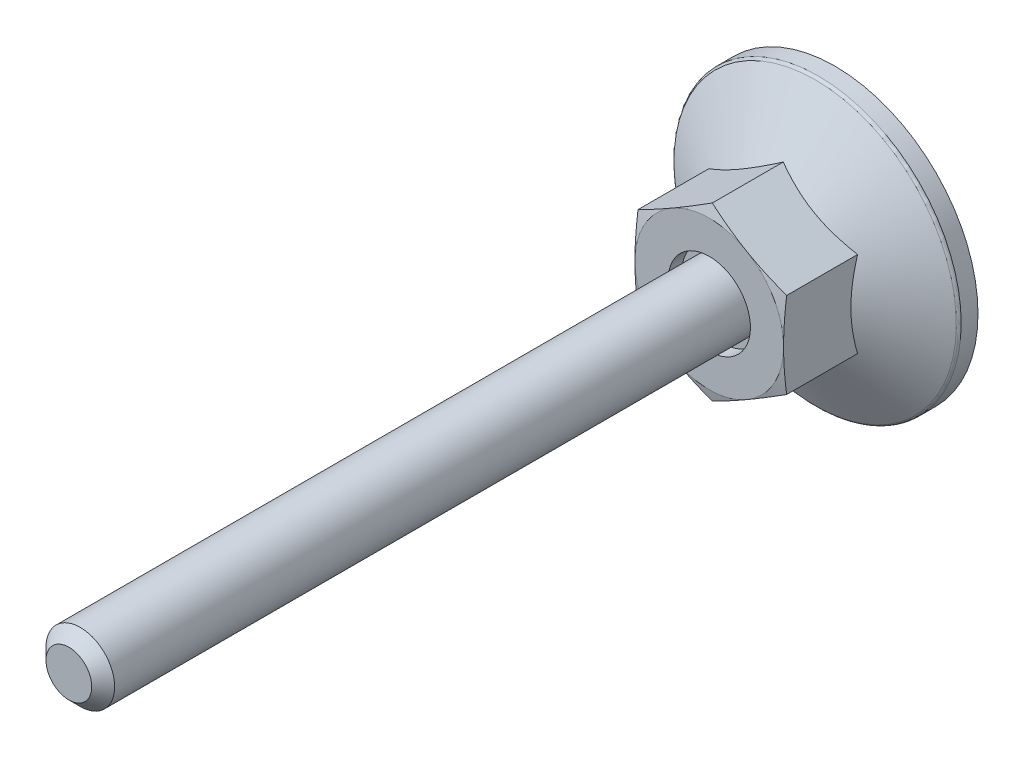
ISO-10303-21;
HEADER;
FILE_DESCRIPTION(('STEP AP214'),'2;1');
FILE_NAME('part.step','',(''),(''),'','','');
FILE_SCHEMA(('AUTOMOTIVE_DESIGN { 1 0 10303 214 1 1 1 1 }'));
ENDSEC;
DATA;
#1=APPLICATION_CONTEXT('core data for automotive mechanical design processes');
#2=APPLICATION_PROTOCOL_DEFINITION('international standard','automotive_design',2000,#1);
#3=PRODUCT_CONTEXT('',#1,'mechanical');
#4=PRODUCT('Part','Part','',(#3));
#5=PRODUCT_RELATED_PRODUCT_CATEGORY('part','',(#4));
#6=PRODUCT_DEFINITION_FORMATION('','',#4);
#7=PRODUCT_DEFINITION_CONTEXT('part definition',#1,'design');
#8=PRODUCT_DEFINITION('design','',#6,#7);
#9=PRODUCT_DEFINITION_SHAPE('','',#8);
#10=(LENGTH_UNIT() NAMED_UNIT(*) SI_UNIT(.MILLI.,.METRE.));
#11=(NAMED_UNIT(*) PLANE_ANGLE_UNIT() SI_UNIT($,.RADIAN.));
#12=(NAMED_UNIT(*) SI_UNIT($,.STERADIAN.) SOLID_ANGLE_UNIT());
#13=UNCERTAINTY_MEASURE_WITH_UNIT(LENGTH_MEASURE(1.E-05),#10,'distance_accuracy_value','');
#14=(GEOMETRIC_REPRESENTATION_CONTEXT(3) GLOBAL_UNCERTAINTY_ASSIGNED_CONTEXT((#13)) GLOBAL_UNIT_ASSIGNED_CONTEXT((#10,
#11,#12)) REPRESENTATION_CONTEXT('',''));
#15=CARTESIAN_POINT('',(0.,0.,0.));
#16=DIRECTION('',(0.,0.,1.));
#17=DIRECTION('',(1.,0.,0.));
#18=AXIS2_PLACEMENT_3D('',#15,#16,#17);
#19=CARTESIAN_POINT('',(7.8,0.,0.));
#20=DIRECTION('',(0.,0.,1.));
#21=DIRECTION('',(0.,-1.,0.));
#22=AXIS2_PLACEMENT_3D('',#19,#20,#21);
#23=PLANE('',#22);
#24=DIRECTION('',(1.,0.,0.));
#25=VECTOR('',#24,1.);
#26=CARTESIAN_POINT('',(1.,-1.,0.));
#27=LINE('',#26,#25);
#28=CARTESIAN_POINT('',(1.,-1.,0.));
#29=VERTEX_POINT('',#28);
#30=CARTESIAN_POINT('',(4.16666666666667,-1.,0.));
#31=VERTEX_POINT('',#30);
#32=EDGE_CURVE('E353',#29,#31,#27,.T.);
#33=ORIENTED_EDGE('',*,*,#32,.T.);
#34=DIRECTION('',(0.,-1.,0.));
#35=VECTOR('',#34,1.);
#36=CARTESIAN_POINT('',(4.16666666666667,0.,0.));
#37=LINE('',#36,#35);
#38=CARTESIAN_POINT('',(4.16666666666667,1.,0.));
#39=VERTEX_POINT('',#38);
#40=EDGE_CURVE('E375',#39,#31,#37,.T.);
#41=ORIENTED_EDGE('',*,*,#40,.F.);
#42=DIRECTION('',(-1.,0.,0.));
#43=VECTOR('',#42,1.);
#44=CARTESIAN_POINT('',(4.16666666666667,1.,0.));
#45=LINE('',#44,#43);
#46=CARTESIAN_POINT('',(1.,1.,0.));
#47=VERTEX_POINT('',#46);
#48=EDGE_CURVE('E737',#39,#47,#45,.T.);
#49=ORIENTED_EDGE('',*,*,#48,.T.);
#50=DIRECTION('',(0.,1.,0.));
#51=VECTOR('',#50,1.);
#52=CARTESIAN_POINT('',(1.,1.,0.));
#53=LINE('',#52,#51);
#54=CARTESIAN_POINT('',(1.,4.16666666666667,0.));
#55=VERTEX_POINT('',#54);
#56=EDGE_CURVE('E734',#47,#55,#53,.T.);
#57=ORIENTED_EDGE('',*,*,#56,.T.);
#58=DIRECTION('',(-1.,0.,0.));
#59=VECTOR('',#58,1.);
#60=CARTESIAN_POINT('',(1.,4.16666666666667,0.));
#61=LINE('',#60,#59);
#62=CARTESIAN_POINT('',(-1.,4.16666666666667,0.));
#63=VERTEX_POINT('',#62);
#64=EDGE_CURVE('E728',#55,#63,#61,.T.);
#65=ORIENTED_EDGE('',*,*,#64,.T.);
#66=DIRECTION('',(0.,-1.,0.));
#67=VECTOR('',#66,1.);
#68=CARTESIAN_POINT('',(-1.,4.16666666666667,0.));
#69=LINE('',#68,#67);
#70=CARTESIAN_POINT('',(-1.,1.,0.));
#71=VERTEX_POINT('',#70);
#72=EDGE_CURVE('E175',#63,#71,#69,.T.);
#73=ORIENTED_EDGE('',*,*,#72,.T.);
#74=DIRECTION('',(-1.,0.,0.));
#75=VECTOR('',#74,1.);
#76=CARTESIAN_POINT('',(-1.,1.,0.));
#77=LINE('',#76,#75);
#78=CARTESIAN_POINT('',(-4.16666666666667,1.,0.));
#79=VERTEX_POINT('',#78);
#80=EDGE_CURVE('E29',#71,#79,#77,.T.);
#81=ORIENTED_EDGE('',*,*,#80,.T.);
#82=DIRECTION('',(0.,-1.,0.));
#83=VECTOR('',#82,1.);
#84=CARTESIAN_POINT('',(-4.16666666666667,1.,0.));
#85=LINE('',#84,#83);
#86=CARTESIAN_POINT('',(-4.16666666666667,-1.,0.));
#87=VERTEX_POINT('',#86);
#88=EDGE_CURVE('E179',#79,#87,#85,.T.);
#89=ORIENTED_EDGE('',*,*,#88,.T.);
#90=DIRECTION('',(1.,0.,0.));
#91=VECTOR('',#90,1.);
#92=CARTESIAN_POINT('',(-4.16666666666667,-1.,0.));
#93=LINE('',#92,#91);
#94=CARTESIAN_POINT('',(-1.,-1.,0.));
#95=VERTEX_POINT('',#94);
#96=EDGE_CURVE('E762',#87,#95,#93,.T.);
#97=ORIENTED_EDGE('',*,*,#96,.T.);
#98=DIRECTION('',(0.,-1.,0.));
#99=VECTOR('',#98,1.);
#100=CARTESIAN_POINT('',(-1.,-1.,0.));
#101=LINE('',#100,#99);
#102=CARTESIAN_POINT('',(-1.,-4.16666666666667,0.));
#103=VERTEX_POINT('',#102);
#104=EDGE_CURVE('E764',#95,#103,#101,.T.);
#105=ORIENTED_EDGE('',*,*,#104,.T.);
#106=DIRECTION('',(1.,0.,0.));
#107=VECTOR('',#106,1.);
#108=CARTESIAN_POINT('',(-1.,-4.16666666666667,0.));
#109=LINE('',#108,#107);
#110=CARTESIAN_POINT('',(1.,-4.16666666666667,0.));
#111=VERTEX_POINT('',#110);
#112=EDGE_CURVE('E768',#103,#111,#109,.T.);
#113=ORIENTED_EDGE('',*,*,#112,.T.);
#114=DIRECTION('',(0.,1.,0.));
#115=VECTOR('',#114,1.);
#116=CARTESIAN_POINT('',(1.,-4.16666666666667,0.));
#117=LINE('',#116,#115);
#118=EDGE_CURVE('E775',#111,#29,#117,.T.);
#119=ORIENTED_EDGE('',*,*,#118,.T.);
#120=EDGE_LOOP('',(#33,#41,#49,#57,#65,#73,#81,#89,#97,#105,#113,#119));
#121=FACE_BOUND('',#120,.T.);
#122=CARTESIAN_POINT('',(0.,0.,0.));
#123=DIRECTION('',(0.,0.,-1.));
#124=DIRECTION('',(0.,1.,0.));
#125=AXIS2_PLACEMENT_3D('',#122,#123,#124);
#126=CIRCLE('',#125,12.5);
#127=CARTESIAN_POINT('',(0.,12.5,0.));
#128=VERTEX_POINT('',#127);
#129=EDGE_CURVE('E184',#128,#128,#126,.T.);
#130=ORIENTED_EDGE('',*,*,#129,.T.);
#131=EDGE_LOOP('',(#130));
#132=FACE_BOUND('',#131,.T.);
#133=ADVANCED_FACE('F14',(#121,#132),#23,.F.);
#134=CARTESIAN_POINT('',(0.,0.,9.8));
#135=DIRECTION('',(0.,0.,-1.));
#136=DIRECTION('',(0.,1.,0.));
#137=AXIS2_PLACEMENT_3D('',#134,#135,#136);
#138=PLANE('',#137);
#139=CARTESIAN_POINT('',(0.,0.,9.8));
#140=DIRECTION('',(0.,0.,-1.));
#141=DIRECTION('',(0.,1.,0.));
#142=AXIS2_PLACEMENT_3D('',#139,#140,#141);
#143=CIRCLE('',#142,3.6);
#144=CARTESIAN_POINT('',(0.,3.6,9.8));
#145=VERTEX_POINT('',#144);
#146=EDGE_CURVE('E376',#145,#145,#143,.T.);
#147=ORIENTED_EDGE('',*,*,#146,.F.);
#148=EDGE_LOOP('',(#147));
#149=FACE_BOUND('',#148,.T.);
#150=CARTESIAN_POINT('',(0.,0.,9.8));
#151=DIRECTION('',(0.,0.,-1.));
#152=DIRECTION('',(0.,1.,0.));
#153=AXIS2_PLACEMENT_3D('',#150,#151,#152);
#154=CIRCLE('',#153,3.);
#155=CARTESIAN_POINT('',(0.,3.,9.8));
#156=VERTEX_POINT('',#155);
#157=EDGE_CURVE('E180',#156,#156,#154,.F.);
#158=ORIENTED_EDGE('',*,*,#157,.F.);
#159=EDGE_LOOP('',(#158));
#160=FACE_BOUND('',#159,.T.);
#161=ADVANCED_FACE('F341',(#149,#160),#138,.F.);
#162=CARTESIAN_POINT('',(0.,7.50555349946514,48.));
#163=DIRECTION('',(0.5,-0.866025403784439,0.));
#164=DIRECTION('',(0.866025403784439,0.5,0.));
#165=AXIS2_PLACEMENT_3D('',#162,#163,#164);
#166=PLANE('',#165);
#167=CARTESIAN_POINT('',(-6.5002,3.75266127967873,4.53347836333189));
#168=CARTESIAN_POINT('',(-6.35732254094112,3.83515161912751,4.58109719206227));
#169=CARTESIAN_POINT('',(-6.21391236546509,3.91794952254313,4.62655491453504));
#170=CARTESIAN_POINT('',(-5.92592736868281,4.08421773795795,4.7125529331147));
#171=CARTESIAN_POINT('',(-5.78135207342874,4.16768832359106,4.75309110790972));
#172=CARTESIAN_POINT('',(-5.34531134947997,4.41943655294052,4.86653061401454));
#173=CARTESIAN_POINT('',(-5.05212471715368,4.5887079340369,4.93105380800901));
#174=CARTESIAN_POINT('',(-4.61337625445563,4.84201947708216,5.00671503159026));
#175=CARTESIAN_POINT('',(-4.46912536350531,4.92530276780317,5.02826875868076));
#176=CARTESIAN_POINT('',(-4.17997178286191,5.09224566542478,5.06441130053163));
#177=CARTESIAN_POINT('',(-4.03506915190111,5.17590523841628,5.07900073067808));
#178=CARTESIAN_POINT('',(-3.74501222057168,5.34336968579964,5.1008428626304));
#179=CARTESIAN_POINT('',(-3.59985839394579,5.42717428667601,5.10810389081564));
#180=CARTESIAN_POINT('',(-3.30942466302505,5.59485627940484,5.11514131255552));
#181=CARTESIAN_POINT('',(-3.16414476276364,5.6787336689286,5.11491793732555));
#182=CARTESIAN_POINT('',(-2.7661240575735,5.90853103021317,5.10401815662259));
#183=CARTESIAN_POINT('',(-2.51351353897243,6.05437578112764,5.08571979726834));
#184=CARTESIAN_POINT('',(-2.00997032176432,6.34509659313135,5.02769527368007));
#185=CARTESIAN_POINT('',(-1.75903939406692,6.48997163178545,4.98794927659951));
#186=CARTESIAN_POINT('',(-1.25448277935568,6.78127752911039,4.8885957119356));
#187=CARTESIAN_POINT('',(-1.00092075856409,6.92767163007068,4.82856718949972));
#188=CARTESIAN_POINT('',(-0.497578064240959,7.21827667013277,4.69232662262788));
#189=CARTESIAN_POINT('',(-0.247790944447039,7.36249133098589,4.61614658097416));
#190=CARTESIAN_POINT('',(0.000199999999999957,7.50566896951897,4.53347836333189));
#191=B_SPLINE_CURVE_WITH_KNOTS('',3,(#167,#168,#169,#170,#171,#172,#173,#174,#175,#176,#177,
#178,#179,#180,#181,#182,#183,#184,#185,#186,#187,#188,#189,#190),.UNSPECIFIED.,.F.,.F.,(4,2,2,
2,2,2,2,2,2,2,2,4),(0.,0.515105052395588,1.03043143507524,2.06322554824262,2.56697389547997,
3.07067772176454,3.57380860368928,4.0769239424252,4.9527935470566,5.82947446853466,
6.72559912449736,7.61996451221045),.UNSPECIFIED.);
#192=CARTESIAN_POINT('',(-6.5,3.75277674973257,4.53354503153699));
#193=VERTEX_POINT('',#192);
#194=CARTESIAN_POINT('',(0.,7.50555349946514,4.53354503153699));
#195=VERTEX_POINT('',#194);
#196=EDGE_CURVE('E254',#193,#195,#191,.T.);
#197=ORIENTED_EDGE('',*,*,#196,.F.);
#198=DIRECTION('',(0.,0.,-1.));
#199=VECTOR('',#198,1.);
#200=CARTESIAN_POINT('',(-6.5,3.75277674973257,48.));
#201=LINE('',#200,#199);
#202=CARTESIAN_POINT('',(-6.5,3.75277674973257,10.730562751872));
#203=VERTEX_POINT('',#202);
#204=EDGE_CURVE('E429',#203,#193,#201,.T.);
#205=ORIENTED_EDGE('',*,*,#204,.F.);
#206=CARTESIAN_POINT('',(0.0002,7.50566896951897,10.7305318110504));
#207=CARTESIAN_POINT('',(-0.26974524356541,7.34981601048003,10.772310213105));
#208=CARTESIAN_POINT('',(-0.540179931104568,7.19368047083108,10.8102381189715));
#209=CARTESIAN_POINT('',(-1.08200437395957,6.88085798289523,10.8768739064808));
#210=CARTESIAN_POINT('',(-1.35339447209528,6.72417083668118,10.9055780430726));
#211=CARTESIAN_POINT('',(-1.8954842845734,6.41119513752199,10.9520905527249));
#212=CARTESIAN_POINT('',(-2.16618033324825,6.25490870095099,10.9699543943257));
#213=CARTESIAN_POINT('',(-2.70791763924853,5.94213652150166,10.9939079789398));
#214=CARTESIAN_POINT('',(-2.97895881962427,5.78565082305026,11.));
#215=CARTESIAN_POINT('',(-3.52104118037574,5.47267942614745,11.));
#216=CARTESIAN_POINT('',(-3.79208236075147,5.31619372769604,10.9939079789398));
#217=CARTESIAN_POINT('',(-4.33381966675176,5.00342154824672,10.9699543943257));
#218=CARTESIAN_POINT('',(-4.60451571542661,4.84713511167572,10.9520905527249));
#219=CARTESIAN_POINT('',(-5.14660552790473,4.53415941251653,10.9055780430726));
#220=CARTESIAN_POINT('',(-5.41799562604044,4.37747226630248,10.8768739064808));
#221=CARTESIAN_POINT('',(-5.95982006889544,4.06464977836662,10.8102381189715));
#222=CARTESIAN_POINT('',(-6.23025475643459,3.90851423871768,10.772310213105));
#223=CARTESIAN_POINT('',(-6.5002,3.75266127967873,10.7305318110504));
#224=B_SPLINE_CURVE_WITH_KNOTS('',3,(#206,#207,#208,#209,#210,#211,#212,#213,#214,#215,#216,
#217,#218,#219,#220,#221,#222,#223),.UNSPECIFIED.,.F.,.F.,(4,2,2,2,2,2,2,2,4),(0.,
0.943529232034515,1.88744107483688,2.82648138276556,3.76533995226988,4.70419852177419,
5.64323882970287,6.58715067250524,7.53067990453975),.UNSPECIFIED.);
#225=CARTESIAN_POINT('',(-3.25,5.62916512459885,11.));
#226=VERTEX_POINT('',#225);
#227=EDGE_CURVE('E284',#226,#203,#224,.T.);
#228=ORIENTED_EDGE('',*,*,#227,.F.);
#229=CARTESIAN_POINT('',(0.,7.50555349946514,10.730562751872));
#230=VERTEX_POINT('',#229);
#231=EDGE_CURVE('E394',#230,#226,#224,.T.);
#232=ORIENTED_EDGE('',*,*,#231,.F.);
#233=DIRECTION('',(0.,0.,-1.));
#234=VECTOR('',#233,1.);
#235=CARTESIAN_POINT('',(0.,7.50555349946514,48.));
#236=LINE('',#235,#234);
#237=EDGE_CURVE('E415',#230,#195,#236,.T.);
#238=ORIENTED_EDGE('',*,*,#237,.T.);
#239=EDGE_LOOP('',(#197,#205,#228,#232,#238));
#240=FACE_BOUND('',#239,.T.);
#241=ADVANCED_FACE('F226',(#240),#166,.F.);
#242=CARTESIAN_POINT('',(6.5,3.75277674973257,48.));
#243=DIRECTION('',(-0.5,-0.866025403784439,0.));
#244=DIRECTION('',(0.866025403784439,-0.5,0.));
#245=AXIS2_PLACEMENT_3D('',#242,#243,#244);
#246=PLANE('',#245);
#247=CARTESIAN_POINT('',(-0.0002,7.50566896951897,4.53347836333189));
#248=CARTESIAN_POINT('',(0.142677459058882,7.4231786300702,4.58109719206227));
#249=CARTESIAN_POINT('',(0.286087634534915,7.34038072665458,4.62655491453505));
#250=CARTESIAN_POINT('',(0.574072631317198,7.17411251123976,4.71255293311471));
#251=CARTESIAN_POINT('',(0.718647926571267,7.09064192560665,4.75309110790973));
#252=CARTESIAN_POINT('',(1.15468865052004,6.83889369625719,4.86653061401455));
#253=CARTESIAN_POINT('',(1.44787528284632,6.66962231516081,4.93105380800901));
#254=CARTESIAN_POINT('',(1.88662374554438,6.41631077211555,5.00671503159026));
#255=CARTESIAN_POINT('',(2.03087463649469,6.33302748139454,5.02826875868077));
#256=CARTESIAN_POINT('',(2.32002821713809,6.16608458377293,5.06441130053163));
#257=CARTESIAN_POINT('',(2.46493084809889,6.08242501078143,5.07900073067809));
#258=CARTESIAN_POINT('',(2.75498777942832,5.91496056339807,5.10084286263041));
#259=CARTESIAN_POINT('',(2.90014160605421,5.8311559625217,5.10810389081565));
#260=CARTESIAN_POINT('',(3.19057533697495,5.66347396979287,5.11514131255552));
#261=CARTESIAN_POINT('',(3.33585523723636,5.5795965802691,5.11491793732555));
#262=CARTESIAN_POINT('',(3.73387594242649,5.34979921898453,5.10401815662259));
#263=CARTESIAN_POINT('',(3.98648646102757,5.20395446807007,5.08571979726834));
#264=CARTESIAN_POINT('',(4.49002967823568,4.91323365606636,5.02769527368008));
#265=CARTESIAN_POINT('',(4.74096060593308,4.76835861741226,4.98794927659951));
#266=CARTESIAN_POINT('',(5.24551722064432,4.47705272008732,4.8885957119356));
#267=CARTESIAN_POINT('',(5.49907924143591,4.33065861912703,4.82856718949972));
#268=CARTESIAN_POINT('',(6.00242193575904,4.04005357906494,4.69232662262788));
#269=CARTESIAN_POINT('',(6.25220905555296,3.89583891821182,4.61614658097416));
#270=CARTESIAN_POINT('',(6.5002,3.75266127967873,4.53347836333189));
#271=B_SPLINE_CURVE_WITH_KNOTS('',3,(#247,#248,#249,#250,#251,#252,#253,#254,#255,#256,#257,
#258,#259,#260,#261,#262,#263,#264,#265,#266,#267,#268,#269,#270),.UNSPECIFIED.,.F.,.F.,(4,2,2,
2,2,2,2,2,2,2,2,4),(0.,0.515105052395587,1.03043143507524,2.06322554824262,2.56697389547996,
3.07067772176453,3.57380860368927,4.0769239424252,4.9527935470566,5.82947446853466,
6.72559912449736,7.61996451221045),.UNSPECIFIED.);
#272=CARTESIAN_POINT('',(6.5,3.75277674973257,4.53354503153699));
#273=VERTEX_POINT('',#272);
#274=EDGE_CURVE('E37',#195,#273,#271,.T.);
#275=ORIENTED_EDGE('',*,*,#274,.F.);
#276=ORIENTED_EDGE('',*,*,#237,.F.);
#277=CARTESIAN_POINT('',(6.5002,3.75266127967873,10.7305318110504));
#278=CARTESIAN_POINT('',(6.23025475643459,3.90851423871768,10.772310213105));
#279=CARTESIAN_POINT('',(5.95982006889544,4.06464977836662,10.8102381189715));
#280=CARTESIAN_POINT('',(5.41799562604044,4.37747226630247,10.8768739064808));
#281=CARTESIAN_POINT('',(5.14660552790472,4.53415941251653,10.9055780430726));
#282=CARTESIAN_POINT('',(4.60451571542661,4.84713511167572,10.9520905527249));
#283=CARTESIAN_POINT('',(4.33381966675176,5.00342154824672,10.9699543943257));
#284=CARTESIAN_POINT('',(3.79208236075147,5.31619372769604,10.9939079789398));
#285=CARTESIAN_POINT('',(3.52104118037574,5.47267942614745,11.));
#286=CARTESIAN_POINT('',(2.97895881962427,5.78565082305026,11.));
#287=CARTESIAN_POINT('',(2.70791763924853,5.94213652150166,10.9939079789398));
#288=CARTESIAN_POINT('',(2.16618033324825,6.25490870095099,10.9699543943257));
#289=CARTESIAN_POINT('',(1.89548428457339,6.41119513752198,10.9520905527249));
#290=CARTESIAN_POINT('',(1.35339447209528,6.72417083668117,10.9055780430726));
#291=CARTESIAN_POINT('',(1.08200437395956,6.88085798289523,10.8768739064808));
#292=CARTESIAN_POINT('',(0.540179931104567,7.19368047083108,10.8102381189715));
#293=CARTESIAN_POINT('',(0.26974524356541,7.34981601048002,10.772310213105));
#294=CARTESIAN_POINT('',(-0.000199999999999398,7.50566896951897,10.7305318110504));
#295=B_SPLINE_CURVE_WITH_KNOTS('',3,(#277,#278,#279,#280,#281,#282,#283,#284,#285,#286,#287,
#288,#289,#290,#291,#292,#293,#294),.UNSPECIFIED.,.F.,.F.,(4,2,2,2,2,2,2,2,4),(0.,
0.943529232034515,1.88744107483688,2.82648138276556,3.76533995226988,4.70419852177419,
5.64323882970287,6.58715067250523,7.53067990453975),.UNSPECIFIED.);
#296=CARTESIAN_POINT('',(3.25,5.62916512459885,11.));
#297=VERTEX_POINT('',#296);
#298=EDGE_CURVE('E267',#297,#230,#295,.T.);
#299=ORIENTED_EDGE('',*,*,#298,.F.);
#300=CARTESIAN_POINT('',(6.5,3.75277674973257,10.730562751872));
#301=VERTEX_POINT('',#300);
#302=EDGE_CURVE('E276',#301,#297,#295,.T.);
#303=ORIENTED_EDGE('',*,*,#302,.F.);
#304=DIRECTION('',(0.,0.,-1.));
#305=VECTOR('',#304,1.);
#306=CARTESIAN_POINT('',(6.5,3.75277674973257,48.));
#307=LINE('',#306,#305);
#308=EDGE_CURVE('E417',#301,#273,#307,.T.);
#309=ORIENTED_EDGE('',*,*,#308,.T.);
#310=EDGE_LOOP('',(#275,#276,#299,#303,#309));
#311=FACE_BOUND('',#310,.T.);
#312=ADVANCED_FACE('F260',(#311),#246,.F.);
#313=CARTESIAN_POINT('',(6.5,-3.75277674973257,48.));
#314=DIRECTION('',(-1.,0.,0.));
#315=DIRECTION('',(0.,-1.,0.));
#316=AXIS2_PLACEMENT_3D('',#313,#314,#315);
#317=PLANE('',#316);
#318=CARTESIAN_POINT('',(6.5,10.067414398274,1.94823609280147));
#319=CARTESIAN_POINT('',(6.5,9.78352438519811,2.08589580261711));
#320=CARTESIAN_POINT('',(6.5,9.49898106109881,2.22223138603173));
#321=CARTESIAN_POINT('',(6.5,8.92824011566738,2.49150895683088));
#322=CARTESIAN_POINT('',(6.5,8.64204224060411,2.62445040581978));
#323=CARTESIAN_POINT('',(6.5,8.06616487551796,2.88686541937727));
#324=CARTESIAN_POINT('',(6.5,7.77647490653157,3.01631606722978));
#325=CARTESIAN_POINT('',(6.5,7.19478507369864,3.26989907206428));
#326=CARTESIAN_POINT('',(6.5,6.90278532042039,3.39403168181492));
#327=CARTESIAN_POINT('',(6.5,6.30684739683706,3.63934571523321));
#328=CARTESIAN_POINT('',(6.5,6.00282105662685,3.76031411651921));
#329=CARTESIAN_POINT('',(6.5,5.39120706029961,3.99306391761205));
#330=CARTESIAN_POINT('',(6.5,5.08361900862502,4.10484428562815));
#331=CARTESIAN_POINT('',(6.5,4.46497231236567,4.31627594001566));
#332=CARTESIAN_POINT('',(6.5,4.15392216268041,4.41595183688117));
#333=CARTESIAN_POINT('',(6.5,3.52735818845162,4.59996747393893));
#334=CARTESIAN_POINT('',(6.5,3.21184580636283,4.68431205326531));
#335=CARTESIAN_POINT('',(6.5,2.57783458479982,4.83319256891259));
#336=CARTESIAN_POINT('',(6.5,2.25935972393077,4.89782898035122));
#337=CARTESIAN_POINT('',(6.5,1.61842059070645,5.00357646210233));
#338=CARTESIAN_POINT('',(6.5,1.29595672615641,5.04468991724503));
#339=CARTESIAN_POINT('',(6.5,0.812693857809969,5.08598811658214));
#340=CARTESIAN_POINT('',(6.5,0.652724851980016,5.09635596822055));
#341=CARTESIAN_POINT('',(6.5,0.332484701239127,5.11032435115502));
#342=CARTESIAN_POINT('',(6.5,0.172213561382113,5.11392499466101));
#343=CARTESIAN_POINT('',(6.5,-0.148338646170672,5.11426557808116));
#344=CARTESIAN_POINT('',(6.5,-0.30861971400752,5.11100536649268));
#345=CARTESIAN_POINT('',(6.5,-0.628902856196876,5.09770543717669));
#346=CARTESIAN_POINT('',(6.5,-0.788904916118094,5.08766537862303));
#347=CARTESIAN_POINT('',(6.5,-1.17366735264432,5.05558094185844));
#348=CARTESIAN_POINT('',(6.5,-1.39816400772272,5.03030719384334));
#349=CARTESIAN_POINT('',(6.5,-1.84547349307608,4.96779217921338));
#350=CARTESIAN_POINT('',(6.5,-2.06828609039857,4.93054928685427));
#351=CARTESIAN_POINT('',(6.5,-2.73393776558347,4.80284369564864));
#352=CARTESIAN_POINT('',(6.5,-3.17375537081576,4.6964262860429));
#353=CARTESIAN_POINT('',(6.5,-3.83171733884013,4.51203063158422));
#354=CARTESIAN_POINT('',(6.5,-4.05327258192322,4.44552609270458));
#355=CARTESIAN_POINT('',(6.5,-4.49422901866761,4.30565892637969));
#356=CARTESIAN_POINT('',(6.5,-4.71363019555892,4.23229624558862));
#357=CARTESIAN_POINT('',(6.5,-5.15035386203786,4.07988627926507));
#358=CARTESIAN_POINT('',(6.5,-5.3676769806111,4.00084077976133));
#359=CARTESIAN_POINT('',(6.5,-5.80052072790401,3.83799065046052));
#360=CARTESIAN_POINT('',(6.5,-6.01604140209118,3.75418614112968));
#361=CARTESIAN_POINT('',(6.5,-6.61842771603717,3.51353035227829));
#362=CARTESIAN_POINT('',(6.5,-7.00350435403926,3.35220459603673));
#363=CARTESIAN_POINT('',(6.5,-7.76959629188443,3.02014813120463));
#364=CARTESIAN_POINT('',(6.5,-8.15061109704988,2.84941629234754));
#365=CARTESIAN_POINT('',(6.5,-8.90957192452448,2.50088582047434));
#366=CARTESIAN_POINT('',(6.5,-9.28751663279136,2.3230843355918));
#367=CARTESIAN_POINT('',(6.5,-10.0408394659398,1.96218611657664));
#368=CARTESIAN_POINT('',(6.5,-10.4162177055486,1.77908962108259));
#369=CARTESIAN_POINT('',(6.5,-11.1655631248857,1.40849620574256));
#370=CARTESIAN_POINT('',(6.5,-11.5395269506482,1.22099251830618));
#371=CARTESIAN_POINT('',(6.5,-12.2858210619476,0.842758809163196));
#372=CARTESIAN_POINT('',(6.5,-12.6581513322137,0.652028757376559));
#373=CARTESIAN_POINT('',(6.5,-13.4013949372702,0.268043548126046));
#374=CARTESIAN_POINT('',(6.5,-13.7723085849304,0.0747889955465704));
#375=CARTESIAN_POINT('',(6.5,-14.5130449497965,-0.313800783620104));
#376=CARTESIAN_POINT('',(6.5,-14.8828676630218,-0.509136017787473));
#377=CARTESIAN_POINT('',(6.5,-15.9085714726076,-1.05391022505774));
#378=CARTESIAN_POINT('',(6.5,-16.5634819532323,-1.40517623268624));
#379=CARTESIAN_POINT('',(6.5,-17.8712672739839,-2.11157255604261));
#380=CARTESIAN_POINT('',(6.5,-18.5241419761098,-2.4667031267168));
#381=CARTESIAN_POINT('',(6.5,-19.8261496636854,-3.17862531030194));
#382=CARTESIAN_POINT('',(6.5,-20.475287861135,-3.53540739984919));
#383=CARTESIAN_POINT('',(6.5,-21.7722968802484,-4.25114422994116));
#384=CARTESIAN_POINT('',(6.5,-22.4201678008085,-4.61009879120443));
#385=CARTESIAN_POINT('',(6.5,-23.0675997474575,-4.9698379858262));
#386=B_SPLINE_CURVE_WITH_KNOTS('',3,(#318,#319,#320,#321,#322,#323,#324,#325,#326,#327,#328,
#329,#330,#331,#332,#333,#334,#335,#336,#337,#338,#339,#340,#341,#342,#343,#344,#345,#346,#347,
#348,#349,#350,#351,#352,#353,#354,#355,#356,#357,#358,#359,#360,#361,#362,#363,#364,#365,#366,
#367,#368,#369,#370,#371,#372,#373,#374,#375,#376,#377,#378,#379,#380,#381,#382,#383,#384,#385),
.UNSPECIFIED.,.F.,.F.,(4,2,2,2,2,2,2,2,2,2,2,2,2,2,2,2,2,2,2,2,2,2,2,2,2,2,2,2,2,2,2,2,2,4),(0.,
0.946528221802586,1.89320566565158,2.84505559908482,3.79686024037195,4.77837094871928,
5.75999172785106,6.73958204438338,7.71886262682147,8.69306383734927,9.66716626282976,
10.1479587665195,10.6287432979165,11.1095384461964,11.5903577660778,12.267719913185,
12.9451741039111,14.3007885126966,14.9946950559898,15.6886069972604,16.3823017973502,
17.0759790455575,18.3282990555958,19.5807698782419,20.8337511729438,22.086676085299,
23.3416700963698,24.5966758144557,25.8513861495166,27.1061010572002,29.335578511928,
31.5652039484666,33.7873748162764,36.0093647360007),.UNSPECIFIED.);
#387=CARTESIAN_POINT('',(6.5,-3.75277674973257,4.53354503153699));
#388=VERTEX_POINT('',#387);
#389=EDGE_CURVE('E243',#273,#388,#386,.T.);
#390=ORIENTED_EDGE('',*,*,#389,.F.);
#391=ORIENTED_EDGE('',*,*,#308,.F.);
#392=CARTESIAN_POINT('',(6.5,9.92747995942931,9.56215186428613));
#393=CARTESIAN_POINT('',(6.5,9.63259364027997,9.62823955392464));
#394=CARTESIAN_POINT('',(6.5,9.33752287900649,9.69351898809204));
#395=CARTESIAN_POINT('',(6.5,8.7469218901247,9.82202506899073));
#396=CARTESIAN_POINT('',(6.5,8.45139164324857,9.88525162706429));
#397=CARTESIAN_POINT('',(6.5,7.85951636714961,10.0092707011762));
#398=CARTESIAN_POINT('',(6.5,7.56317082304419,10.0700607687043));
#399=CARTESIAN_POINT('',(6.5,6.96986292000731,10.1885506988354));
#400=CARTESIAN_POINT('',(6.5,6.67290056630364,10.2462505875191));
#401=CARTESIAN_POINT('',(6.5,6.08062010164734,10.3573796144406));
#402=CARTESIAN_POINT('',(6.5,5.78530770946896,10.4108390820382));
#403=CARTESIAN_POINT('',(6.5,5.19387740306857,10.513090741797));
#404=CARTESIAN_POINT('',(6.5,4.89775950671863,10.5618830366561));
#405=CARTESIAN_POINT('',(6.5,4.30466070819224,10.6537017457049));
#406=CARTESIAN_POINT('',(6.5,4.00767991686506,10.6967288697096));
#407=CARTESIAN_POINT('',(6.5,3.4127732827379,10.7757492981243));
#408=CARTESIAN_POINT('',(6.5,3.1148474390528,10.8117425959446));
#409=CARTESIAN_POINT('',(6.5,2.51468954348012,10.8756761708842));
#410=CARTESIAN_POINT('',(6.5,2.21244707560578,10.9035201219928));
#411=CARTESIAN_POINT('',(6.5,1.60720229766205,10.9492341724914));
#412=CARTESIAN_POINT('',(6.5,1.30420000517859,10.9671045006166));
#413=CARTESIAN_POINT('',(6.5,0.697875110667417,10.9918290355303));
#414=CARTESIAN_POINT('',(6.5,0.394552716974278,10.9986882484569));
#415=CARTESIAN_POINT('',(6.5,-0.212135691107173,11.0009688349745));
#416=CARTESIAN_POINT('',(6.5,-0.515501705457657,10.9963902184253));
#417=CARTESIAN_POINT('',(6.5,-1.12295501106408,10.9760526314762));
#418=CARTESIAN_POINT('',(6.5,-1.42704091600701,10.9602530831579));
#419=CARTESIAN_POINT('',(6.5,-2.03449758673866,10.9183754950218));
#420=CARTESIAN_POINT('',(6.5,-2.33786833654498,10.8922972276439));
#421=CARTESIAN_POINT('',(6.5,-2.94389214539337,10.8311794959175));
#422=CARTESIAN_POINT('',(6.5,-3.24654460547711,10.7961341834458));
#423=CARTESIAN_POINT('',(6.5,-3.85087551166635,10.7185406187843));
#424=CARTESIAN_POINT('',(6.5,-4.15255395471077,10.6759923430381));
#425=CARTESIAN_POINT('',(6.5,-4.73502363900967,10.5877746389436));
#426=CARTESIAN_POINT('',(6.5,-5.01587505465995,10.5424985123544));
#427=CARTESIAN_POINT('',(6.5,-5.57683763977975,10.4475514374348));
#428=CARTESIAN_POINT('',(6.5,-5.85694878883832,10.3978803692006));
#429=CARTESIAN_POINT('',(6.5,-6.41653333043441,10.2949474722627));
#430=CARTESIAN_POINT('',(6.5,-6.69600666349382,10.241685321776));
#431=CARTESIAN_POINT('',(6.5,-7.2543793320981,10.1322258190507));
#432=CARTESIAN_POINT('',(6.5,-7.53327866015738,10.0760284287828));
#433=CARTESIAN_POINT('',(6.5,-8.36936246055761,9.90383082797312));
#434=CARTESIAN_POINT('',(6.5,-8.92580841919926,9.78424858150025));
#435=CARTESIAN_POINT('',(6.5,-10.037220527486,9.53861051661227));
#436=CARTESIAN_POINT('',(6.5,-10.5921867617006,9.41255507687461));
#437=CARTESIAN_POINT('',(6.5,-11.6956125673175,9.15714489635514));
#438=CARTESIAN_POINT('',(6.5,-12.2440824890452,9.02783474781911));
#439=CARTESIAN_POINT('',(6.5,-13.3402571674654,8.76597711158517));
#440=CARTESIAN_POINT('',(6.5,-13.8879619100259,8.63342956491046));
#441=CARTESIAN_POINT('',(6.5,-14.9821103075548,8.36610757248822));
#442=CARTESIAN_POINT('',(6.5,-15.5285546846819,8.23133607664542));
#443=CARTESIAN_POINT('',(6.5,-16.620967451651,7.95995280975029));
#444=CARTESIAN_POINT('',(6.5,-17.166935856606,7.82334109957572));
#445=CARTESIAN_POINT('',(6.5,-17.7127383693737,7.6860776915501));
#446=B_SPLINE_CURVE_WITH_KNOTS('',3,(#392,#393,#394,#395,#396,#397,#398,#399,#400,#401,#402,
#403,#404,#405,#406,#407,#408,#409,#410,#411,#412,#413,#414,#415,#416,#417,#418,#419,#420,#421,
#422,#423,#424,#425,#426,#427,#428,#429,#430,#431,#432,#433,#434,#435,#436,#437,#438,#439,#440,
#441,#442,#443,#444,#445),.UNSPECIFIED.,.F.,.F.,(4,2,2,2,2,2,2,2,2,2,2,2,2,2,2,2,2,2,2,2,2,2,2,
2,2,2,4),(0.,0.906607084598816,1.8132532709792,2.72078883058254,3.62831672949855,
4.52862337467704,5.42891020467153,6.32908608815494,7.22926281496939,8.13968571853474,
9.05008774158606,9.96007573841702,10.8700629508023,11.7833577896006,12.6966728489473,
13.6105850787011,14.5245001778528,15.3778915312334,16.2313061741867,17.084797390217,
17.9382996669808,19.6456836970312,21.3529679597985,23.0434756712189,24.7340142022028,
26.4224665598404,28.1108631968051),.UNSPECIFIED.);
#447=CARTESIAN_POINT('',(6.5,0.,11.));
#448=VERTEX_POINT('',#447);
#449=EDGE_CURVE('E278',#448,#301,#446,.F.);
#450=ORIENTED_EDGE('',*,*,#449,.F.);
#451=CARTESIAN_POINT('',(6.5,-3.75277674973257,10.730562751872));
#452=VERTEX_POINT('',#451);
#453=EDGE_CURVE('E277',#452,#448,#446,.F.);
#454=ORIENTED_EDGE('',*,*,#453,.F.);
#455=DIRECTION('',(0.,0.,-1.));
#456=VECTOR('',#455,1.);
#457=CARTESIAN_POINT('',(6.5,-3.75277674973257,48.));
#458=LINE('',#457,#456);
#459=EDGE_CURVE('E420',#452,#388,#458,.T.);
#460=ORIENTED_EDGE('',*,*,#459,.T.);
#461=EDGE_LOOP('',(#390,#391,#450,#454,#460));
#462=FACE_BOUND('',#461,.T.);
#463=ADVANCED_FACE('F263',(#462),#317,.F.);
#464=CARTESIAN_POINT('',(0.,-7.50555349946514,48.));
#465=DIRECTION('',(-0.5,0.866025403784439,0.));
#466=DIRECTION('',(-0.866025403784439,-0.5,0.));
#467=AXIS2_PLACEMENT_3D('',#464,#465,#466);
#468=PLANE('',#467);
#469=CARTESIAN_POINT('',(6.5002,-3.75266127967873,4.53347836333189));
#470=CARTESIAN_POINT('',(6.35732254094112,-3.83515161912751,4.58109719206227));
#471=CARTESIAN_POINT('',(6.21391236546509,-3.91794952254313,4.62655491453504));
#472=CARTESIAN_POINT('',(5.92592736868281,-4.08421773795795,4.7125529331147));
#473=CARTESIAN_POINT('',(5.78135207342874,-4.16768832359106,4.75309110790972));
#474=CARTESIAN_POINT('',(5.34531134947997,-4.41943655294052,4.86653061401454));
#475=CARTESIAN_POINT('',(5.05212471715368,-4.5887079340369,4.93105380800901));
#476=CARTESIAN_POINT('',(4.61337625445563,-4.84201947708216,5.00671503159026));
#477=CARTESIAN_POINT('',(4.46912536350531,-4.92530276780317,5.02826875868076));
#478=CARTESIAN_POINT('',(4.17997178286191,-5.09224566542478,5.06441130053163));
#479=CARTESIAN_POINT('',(4.03506915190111,-5.17590523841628,5.07900073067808));
#480=CARTESIAN_POINT('',(3.74501222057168,-5.34336968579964,5.1008428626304));
#481=CARTESIAN_POINT('',(3.59985839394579,-5.42717428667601,5.10810389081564));
#482=CARTESIAN_POINT('',(3.30942466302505,-5.59485627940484,5.11514131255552));
#483=CARTESIAN_POINT('',(3.16414476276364,-5.6787336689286,5.11491793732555));
#484=CARTESIAN_POINT('',(2.7661240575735,-5.90853103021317,5.10401815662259));
#485=CARTESIAN_POINT('',(2.51351353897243,-6.05437578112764,5.08571979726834));
#486=CARTESIAN_POINT('',(2.00997032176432,-6.34509659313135,5.02769527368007));
#487=CARTESIAN_POINT('',(1.75903939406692,-6.48997163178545,4.98794927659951));
#488=CARTESIAN_POINT('',(1.25448277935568,-6.78127752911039,4.8885957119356));
#489=CARTESIAN_POINT('',(1.00092075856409,-6.92767163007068,4.82856718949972));
#490=CARTESIAN_POINT('',(0.497578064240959,-7.21827667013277,4.69232662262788));
#491=CARTESIAN_POINT('',(0.247790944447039,-7.36249133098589,4.61614658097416));
#492=CARTESIAN_POINT('',(-0.000199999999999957,-7.50566896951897,4.53347836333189));
#493=B_SPLINE_CURVE_WITH_KNOTS('',3,(#469,#470,#471,#472,#473,#474,#475,#476,#477,#478,#479,
#480,#481,#482,#483,#484,#485,#486,#487,#488,#489,#490,#491,#492),.UNSPECIFIED.,.F.,.F.,(4,2,2,
2,2,2,2,2,2,2,2,4),(0.,0.515105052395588,1.03043143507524,2.06322554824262,2.56697389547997,
3.07067772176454,3.57380860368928,4.0769239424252,4.9527935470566,5.82947446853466,
6.72559912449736,7.61996451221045),.UNSPECIFIED.);
#494=CARTESIAN_POINT('',(0.,-7.50555349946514,4.53354503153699));
#495=VERTEX_POINT('',#494);
#496=EDGE_CURVE('E207',#388,#495,#493,.T.);
#497=ORIENTED_EDGE('',*,*,#496,.F.);
#498=ORIENTED_EDGE('',*,*,#459,.F.);
#499=CARTESIAN_POINT('',(-0.0002,-7.50566896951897,10.7305318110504));
#500=CARTESIAN_POINT('',(0.26974524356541,-7.34981601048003,10.772310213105));
#501=CARTESIAN_POINT('',(0.540179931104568,-7.19368047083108,10.8102381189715));
#502=CARTESIAN_POINT('',(1.08200437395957,-6.88085798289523,10.8768739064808));
#503=CARTESIAN_POINT('',(1.35339447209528,-6.72417083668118,10.9055780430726));
#504=CARTESIAN_POINT('',(1.8954842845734,-6.41119513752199,10.9520905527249));
#505=CARTESIAN_POINT('',(2.16618033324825,-6.25490870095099,10.9699543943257));
#506=CARTESIAN_POINT('',(2.70791763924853,-5.94213652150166,10.9939079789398));
#507=CARTESIAN_POINT('',(2.97895881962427,-5.78565082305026,11.));
#508=CARTESIAN_POINT('',(3.52104118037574,-5.47267942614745,11.));
#509=CARTESIAN_POINT('',(3.79208236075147,-5.31619372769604,10.9939079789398));
#510=CARTESIAN_POINT('',(4.33381966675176,-5.00342154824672,10.9699543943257));
#511=CARTESIAN_POINT('',(4.60451571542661,-4.84713511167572,10.9520905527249));
#512=CARTESIAN_POINT('',(5.14660552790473,-4.53415941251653,10.9055780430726));
#513=CARTESIAN_POINT('',(5.41799562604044,-4.37747226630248,10.8768739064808));
#514=CARTESIAN_POINT('',(5.95982006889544,-4.06464977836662,10.8102381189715));
#515=CARTESIAN_POINT('',(6.23025475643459,-3.90851423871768,10.772310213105));
#516=CARTESIAN_POINT('',(6.5002,-3.75266127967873,10.7305318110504));
#517=B_SPLINE_CURVE_WITH_KNOTS('',3,(#499,#500,#501,#502,#503,#504,#505,#506,#507,#508,#509,
#510,#511,#512,#513,#514,#515,#516),.UNSPECIFIED.,.F.,.F.,(4,2,2,2,2,2,2,2,4),(0.,
0.943529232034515,1.88744107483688,2.82648138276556,3.76533995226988,4.70419852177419,
5.64323882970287,6.58715067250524,7.53067990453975),.UNSPECIFIED.);
#518=CARTESIAN_POINT('',(3.25,-5.62916512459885,11.));
#519=VERTEX_POINT('',#518);
#520=EDGE_CURVE('E317',#519,#452,#517,.T.);
#521=ORIENTED_EDGE('',*,*,#520,.F.);
#522=CARTESIAN_POINT('',(0.,-7.50555349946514,10.730562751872));
#523=VERTEX_POINT('',#522);
#524=EDGE_CURVE('E323',#523,#519,#517,.T.);
#525=ORIENTED_EDGE('',*,*,#524,.F.);
#526=DIRECTION('',(0.,0.,-1.));
#527=VECTOR('',#526,1.);
#528=CARTESIAN_POINT('',(0.,-7.50555349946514,48.));
#529=LINE('',#528,#527);
#530=EDGE_CURVE('E425',#523,#495,#529,.T.);
#531=ORIENTED_EDGE('',*,*,#530,.T.);
#532=EDGE_LOOP('',(#497,#498,#521,#525,#531));
#533=FACE_BOUND('',#532,.T.);
#534=ADVANCED_FACE('F325',(#533),#468,.F.);
#535=CARTESIAN_POINT('',(-6.5,-3.75277674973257,48.));
#536=DIRECTION('',(0.5,0.866025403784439,0.));
#537=DIRECTION('',(-0.866025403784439,0.5,0.));
#538=AXIS2_PLACEMENT_3D('',#535,#536,#537);
#539=PLANE('',#538);
#540=CARTESIAN_POINT('',(0.0002,-7.50566896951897,4.53347836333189));
#541=CARTESIAN_POINT('',(-0.142677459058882,-7.4231786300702,4.58109719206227));
#542=CARTESIAN_POINT('',(-0.286087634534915,-7.34038072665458,4.62655491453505));
#543=CARTESIAN_POINT('',(-0.574072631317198,-7.17411251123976,4.71255293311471));
#544=CARTESIAN_POINT('',(-0.718647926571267,-7.09064192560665,4.75309110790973));
#545=CARTESIAN_POINT('',(-1.15468865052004,-6.83889369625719,4.86653061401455));
#546=CARTESIAN_POINT('',(-1.44787528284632,-6.66962231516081,4.93105380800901));
#547=CARTESIAN_POINT('',(-1.88662374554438,-6.41631077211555,5.00671503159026));
#548=CARTESIAN_POINT('',(-2.03087463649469,-6.33302748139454,5.02826875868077));
#549=CARTESIAN_POINT('',(-2.32002821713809,-6.16608458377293,5.06441130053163));
#550=CARTESIAN_POINT('',(-2.46493084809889,-6.08242501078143,5.07900073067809));
#551=CARTESIAN_POINT('',(-2.75498777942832,-5.91496056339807,5.10084286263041));
#552=CARTESIAN_POINT('',(-2.90014160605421,-5.8311559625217,5.10810389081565));
#553=CARTESIAN_POINT('',(-3.19057533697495,-5.66347396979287,5.11514131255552));
#554=CARTESIAN_POINT('',(-3.33585523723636,-5.5795965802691,5.11491793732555));
#555=CARTESIAN_POINT('',(-3.73387594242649,-5.34979921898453,5.10401815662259));
#556=CARTESIAN_POINT('',(-3.98648646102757,-5.20395446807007,5.08571979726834));
#557=CARTESIAN_POINT('',(-4.49002967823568,-4.91323365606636,5.02769527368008));
#558=CARTESIAN_POINT('',(-4.74096060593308,-4.76835861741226,4.98794927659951));
#559=CARTESIAN_POINT('',(-5.24551722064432,-4.47705272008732,4.8885957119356));
#560=CARTESIAN_POINT('',(-5.49907924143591,-4.33065861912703,4.82856718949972));
#561=CARTESIAN_POINT('',(-6.00242193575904,-4.04005357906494,4.69232662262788));
#562=CARTESIAN_POINT('',(-6.25220905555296,-3.89583891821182,4.61614658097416));
#563=CARTESIAN_POINT('',(-6.5002,-3.75266127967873,4.53347836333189));
#564=B_SPLINE_CURVE_WITH_KNOTS('',3,(#540,#541,#542,#543,#544,#545,#546,#547,#548,#549,#550,
#551,#552,#553,#554,#555,#556,#557,#558,#559,#560,#561,#562,#563),.UNSPECIFIED.,.F.,.F.,(4,2,2,
2,2,2,2,2,2,2,2,4),(0.,0.515105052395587,1.03043143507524,2.06322554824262,2.56697389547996,
3.07067772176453,3.57380860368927,4.0769239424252,4.9527935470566,5.82947446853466,
6.72559912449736,7.61996451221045),.UNSPECIFIED.);
#565=CARTESIAN_POINT('',(-6.5,-3.75277674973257,4.53354503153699));
#566=VERTEX_POINT('',#565);
#567=EDGE_CURVE('E198',#495,#566,#564,.T.);
#568=ORIENTED_EDGE('',*,*,#567,.F.);
#569=ORIENTED_EDGE('',*,*,#530,.F.);
#570=CARTESIAN_POINT('',(-6.5002,-3.75266127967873,10.7305318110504));
#571=CARTESIAN_POINT('',(-6.23025475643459,-3.90851423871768,10.772310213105));
#572=CARTESIAN_POINT('',(-5.95982006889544,-4.06464977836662,10.8102381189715));
#573=CARTESIAN_POINT('',(-5.41799562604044,-4.37747226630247,10.8768739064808));
#574=CARTESIAN_POINT('',(-5.14660552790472,-4.53415941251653,10.9055780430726));
#575=CARTESIAN_POINT('',(-4.60451571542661,-4.84713511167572,10.9520905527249));
#576=CARTESIAN_POINT('',(-4.33381966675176,-5.00342154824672,10.9699543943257));
#577=CARTESIAN_POINT('',(-3.79208236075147,-5.31619372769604,10.9939079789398));
#578=CARTESIAN_POINT('',(-3.52104118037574,-5.47267942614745,11.));
#579=CARTESIAN_POINT('',(-2.97895881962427,-5.78565082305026,11.));
#580=CARTESIAN_POINT('',(-2.70791763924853,-5.94213652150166,10.9939079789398));
#581=CARTESIAN_POINT('',(-2.16618033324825,-6.25490870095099,10.9699543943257));
#582=CARTESIAN_POINT('',(-1.89548428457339,-6.41119513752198,10.9520905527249));
#583=CARTESIAN_POINT('',(-1.35339447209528,-6.72417083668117,10.9055780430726));
#584=CARTESIAN_POINT('',(-1.08200437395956,-6.88085798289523,10.8768739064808));
#585=CARTESIAN_POINT('',(-0.540179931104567,-7.19368047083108,10.8102381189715));
#586=CARTESIAN_POINT('',(-0.26974524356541,-7.34981601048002,10.772310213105));
#587=CARTESIAN_POINT('',(0.000199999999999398,-7.50566896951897,10.7305318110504));
#588=B_SPLINE_CURVE_WITH_KNOTS('',3,(#570,#571,#572,#573,#574,#575,#576,#577,#578,#579,#580,
#581,#582,#583,#584,#585,#586,#587),.UNSPECIFIED.,.F.,.F.,(4,2,2,2,2,2,2,2,4),(0.,
0.943529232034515,1.88744107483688,2.82648138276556,3.76533995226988,4.70419852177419,
5.64323882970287,6.58715067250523,7.53067990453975),.UNSPECIFIED.);
#589=CARTESIAN_POINT('',(-3.25,-5.62916512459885,11.));
#590=VERTEX_POINT('',#589);
#591=EDGE_CURVE('E311',#590,#523,#588,.T.);
#592=ORIENTED_EDGE('',*,*,#591,.F.);
#593=CARTESIAN_POINT('',(-6.5,-3.75277674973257,10.730562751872));
#594=VERTEX_POINT('',#593);
#595=EDGE_CURVE('E324',#594,#590,#588,.T.);
#596=ORIENTED_EDGE('',*,*,#595,.F.);
#597=DIRECTION('',(0.,0.,-1.));
#598=VECTOR('',#597,1.);
#599=CARTESIAN_POINT('',(-6.5,-3.75277674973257,48.));
#600=LINE('',#599,#598);
#601=EDGE_CURVE('E428',#594,#566,#600,.T.);
#602=ORIENTED_EDGE('',*,*,#601,.T.);
#603=EDGE_LOOP('',(#568,#569,#592,#596,#602));
#604=FACE_BOUND('',#603,.T.);
#605=ADVANCED_FACE('F214',(#604),#539,.F.);
#606=CARTESIAN_POINT('',(-6.5,3.75277674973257,48.));
#607=DIRECTION('',(1.,0.,0.));
#608=DIRECTION('',(0.,1.,0.));
#609=AXIS2_PLACEMENT_3D('',#606,#607,#608);
#610=PLANE('',#609);
#611=CARTESIAN_POINT('',(-6.5,10.067414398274,1.94823609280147));
#612=CARTESIAN_POINT('',(-6.5,9.78352438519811,2.08589580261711));
#613=CARTESIAN_POINT('',(-6.5,9.49898106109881,2.22223138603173));
#614=CARTESIAN_POINT('',(-6.5,8.92824011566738,2.49150895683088));
#615=CARTESIAN_POINT('',(-6.5,8.64204224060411,2.62445040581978));
#616=CARTESIAN_POINT('',(-6.5,8.06616487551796,2.88686541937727));
#617=CARTESIAN_POINT('',(-6.5,7.77647490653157,3.01631606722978));
#618=CARTESIAN_POINT('',(-6.5,7.19478507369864,3.26989907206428));
#619=CARTESIAN_POINT('',(-6.5,6.90278532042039,3.39403168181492));
#620=CARTESIAN_POINT('',(-6.5,6.30684739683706,3.63934571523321));
#621=CARTESIAN_POINT('',(-6.5,6.00282105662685,3.76031411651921));
#622=CARTESIAN_POINT('',(-6.5,5.39120706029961,3.99306391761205));
#623=CARTESIAN_POINT('',(-6.5,5.08361900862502,4.10484428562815));
#624=CARTESIAN_POINT('',(-6.5,4.46497231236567,4.31627594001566));
#625=CARTESIAN_POINT('',(-6.5,4.15392216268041,4.41595183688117));
#626=CARTESIAN_POINT('',(-6.5,3.52735818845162,4.59996747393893));
#627=CARTESIAN_POINT('',(-6.5,3.21184580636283,4.68431205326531));
#628=CARTESIAN_POINT('',(-6.5,2.57783458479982,4.83319256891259));
#629=CARTESIAN_POINT('',(-6.5,2.25935972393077,4.89782898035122));
#630=CARTESIAN_POINT('',(-6.5,1.61842059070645,5.00357646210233));
#631=CARTESIAN_POINT('',(-6.5,1.29595672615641,5.04468991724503));
#632=CARTESIAN_POINT('',(-6.5,0.812693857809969,5.08598811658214));
#633=CARTESIAN_POINT('',(-6.5,0.652724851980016,5.09635596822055));
#634=CARTESIAN_POINT('',(-6.5,0.332484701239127,5.11032435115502));
#635=CARTESIAN_POINT('',(-6.5,0.172213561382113,5.11392499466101));
#636=CARTESIAN_POINT('',(-6.5,-0.148338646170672,5.11426557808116));
#637=CARTESIAN_POINT('',(-6.5,-0.30861971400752,5.11100536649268));
#638=CARTESIAN_POINT('',(-6.5,-0.628902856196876,5.09770543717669));
#639=CARTESIAN_POINT('',(-6.5,-0.788904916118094,5.08766537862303));
#640=CARTESIAN_POINT('',(-6.5,-1.17366735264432,5.05558094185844));
#641=CARTESIAN_POINT('',(-6.5,-1.39816400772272,5.03030719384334));
#642=CARTESIAN_POINT('',(-6.5,-1.84547349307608,4.96779217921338));
#643=CARTESIAN_POINT('',(-6.5,-2.06828609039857,4.93054928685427));
#644=CARTESIAN_POINT('',(-6.5,-2.73393776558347,4.80284369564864));
#645=CARTESIAN_POINT('',(-6.5,-3.17375537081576,4.6964262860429));
#646=CARTESIAN_POINT('',(-6.5,-3.83171733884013,4.51203063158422));
#647=CARTESIAN_POINT('',(-6.5,-4.05327258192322,4.44552609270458));
#648=CARTESIAN_POINT('',(-6.5,-4.49422901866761,4.30565892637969));
#649=CARTESIAN_POINT('',(-6.5,-4.71363019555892,4.23229624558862));
#650=CARTESIAN_POINT('',(-6.5,-5.15035386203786,4.07988627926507));
#651=CARTESIAN_POINT('',(-6.5,-5.3676769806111,4.00084077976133));
#652=CARTESIAN_POINT('',(-6.5,-5.80052072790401,3.83799065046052));
#653=CARTESIAN_POINT('',(-6.5,-6.01604140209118,3.75418614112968));
#654=CARTESIAN_POINT('',(-6.5,-6.61842771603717,3.51353035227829));
#655=CARTESIAN_POINT('',(-6.5,-7.00350435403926,3.35220459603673));
#656=CARTESIAN_POINT('',(-6.5,-7.76959629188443,3.02014813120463));
#657=CARTESIAN_POINT('',(-6.5,-8.15061109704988,2.84941629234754));
#658=CARTESIAN_POINT('',(-6.5,-8.90957192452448,2.50088582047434));
#659=CARTESIAN_POINT('',(-6.5,-9.28751663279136,2.3230843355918));
#660=CARTESIAN_POINT('',(-6.5,-10.0408394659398,1.96218611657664));
#661=CARTESIAN_POINT('',(-6.5,-10.4162177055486,1.77908962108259));
#662=CARTESIAN_POINT('',(-6.5,-11.1655631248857,1.40849620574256));
#663=CARTESIAN_POINT('',(-6.5,-11.5395269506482,1.22099251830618));
#664=CARTESIAN_POINT('',(-6.5,-12.2858210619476,0.842758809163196));
#665=CARTESIAN_POINT('',(-6.5,-12.6581513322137,0.652028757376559));
#666=CARTESIAN_POINT('',(-6.5,-13.4013949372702,0.268043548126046));
#667=CARTESIAN_POINT('',(-6.5,-13.7723085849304,0.0747889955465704));
#668=CARTESIAN_POINT('',(-6.5,-14.5130449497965,-0.313800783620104));
#669=CARTESIAN_POINT('',(-6.5,-14.8828676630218,-0.509136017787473));
#670=CARTESIAN_POINT('',(-6.5,-15.9085714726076,-1.05391022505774));
#671=CARTESIAN_POINT('',(-6.5,-16.5634819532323,-1.40517623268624));
#672=CARTESIAN_POINT('',(-6.5,-17.8712672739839,-2.11157255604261));
#673=CARTESIAN_POINT('',(-6.5,-18.5241419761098,-2.4667031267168));
#674=CARTESIAN_POINT('',(-6.5,-19.8261496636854,-3.17862531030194));
#675=CARTESIAN_POINT('',(-6.5,-20.475287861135,-3.53540739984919));
#676=CARTESIAN_POINT('',(-6.5,-21.7722968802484,-4.25114422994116));
#677=CARTESIAN_POINT('',(-6.5,-22.4201678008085,-4.61009879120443));
#678=CARTESIAN_POINT('',(-6.5,-23.0675997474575,-4.9698379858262));
#679=B_SPLINE_CURVE_WITH_KNOTS('',3,(#611,#612,#613,#614,#615,#616,#617,#618,#619,#620,#621,
#622,#623,#624,#625,#626,#627,#628,#629,#630,#631,#632,#633,#634,#635,#636,#637,#638,#639,#640,
#641,#642,#643,#644,#645,#646,#647,#648,#649,#650,#651,#652,#653,#654,#655,#656,#657,#658,#659,
#660,#661,#662,#663,#664,#665,#666,#667,#668,#669,#670,#671,#672,#673,#674,#675,#676,#677,#678),
.UNSPECIFIED.,.F.,.F.,(4,2,2,2,2,2,2,2,2,2,2,2,2,2,2,2,2,2,2,2,2,2,2,2,2,2,2,2,2,2,2,2,2,4),(0.,
0.946528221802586,1.89320566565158,2.84505559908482,3.79686024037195,4.77837094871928,
5.75999172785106,6.73958204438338,7.71886262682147,8.69306383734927,9.66716626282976,
10.1479587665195,10.6287432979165,11.1095384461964,11.5903577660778,12.267719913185,
12.9451741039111,14.3007885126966,14.9946950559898,15.6886069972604,16.3823017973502,
17.0759790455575,18.3282990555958,19.5807698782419,20.8337511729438,22.086676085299,
23.3416700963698,24.5966758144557,25.8513861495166,27.1061010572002,29.335578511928,
31.5652039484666,33.7873748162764,36.0093647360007),.UNSPECIFIED.);
#680=EDGE_CURVE('E232',#566,#193,#679,.F.);
#681=ORIENTED_EDGE('',*,*,#680,.F.);
#682=ORIENTED_EDGE('',*,*,#601,.F.);
#683=CARTESIAN_POINT('',(-6.5,9.92747995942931,9.56215186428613));
#684=CARTESIAN_POINT('',(-6.5,9.63259364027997,9.62823955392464));
#685=CARTESIAN_POINT('',(-6.5,9.33752287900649,9.69351898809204));
#686=CARTESIAN_POINT('',(-6.5,8.7469218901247,9.82202506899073));
#687=CARTESIAN_POINT('',(-6.5,8.45139164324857,9.88525162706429));
#688=CARTESIAN_POINT('',(-6.5,7.85951636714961,10.0092707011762));
#689=CARTESIAN_POINT('',(-6.5,7.56317082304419,10.0700607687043));
#690=CARTESIAN_POINT('',(-6.5,6.96986292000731,10.1885506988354));
#691=CARTESIAN_POINT('',(-6.5,6.67290056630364,10.2462505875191));
#692=CARTESIAN_POINT('',(-6.5,6.08062010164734,10.3573796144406));
#693=CARTESIAN_POINT('',(-6.5,5.78530770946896,10.4108390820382));
#694=CARTESIAN_POINT('',(-6.5,5.19387740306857,10.513090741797));
#695=CARTESIAN_POINT('',(-6.5,4.89775950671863,10.5618830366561));
#696=CARTESIAN_POINT('',(-6.5,4.30466070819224,10.6537017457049));
#697=CARTESIAN_POINT('',(-6.5,4.00767991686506,10.6967288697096));
#698=CARTESIAN_POINT('',(-6.5,3.4127732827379,10.7757492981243));
#699=CARTESIAN_POINT('',(-6.5,3.1148474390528,10.8117425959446));
#700=CARTESIAN_POINT('',(-6.5,2.51468954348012,10.8756761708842));
#701=CARTESIAN_POINT('',(-6.5,2.21244707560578,10.9035201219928));
#702=CARTESIAN_POINT('',(-6.5,1.60720229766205,10.9492341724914));
#703=CARTESIAN_POINT('',(-6.5,1.30420000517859,10.9671045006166));
#704=CARTESIAN_POINT('',(-6.5,0.697875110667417,10.9918290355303));
#705=CARTESIAN_POINT('',(-6.5,0.394552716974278,10.9986882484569));
#706=CARTESIAN_POINT('',(-6.5,-0.212135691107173,11.0009688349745));
#707=CARTESIAN_POINT('',(-6.5,-0.515501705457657,10.9963902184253));
#708=CARTESIAN_POINT('',(-6.5,-1.12295501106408,10.9760526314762));
#709=CARTESIAN_POINT('',(-6.5,-1.42704091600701,10.9602530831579));
#710=CARTESIAN_POINT('',(-6.5,-2.03449758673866,10.9183754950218));
#711=CARTESIAN_POINT('',(-6.5,-2.33786833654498,10.8922972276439));
#712=CARTESIAN_POINT('',(-6.5,-2.94389214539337,10.8311794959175));
#713=CARTESIAN_POINT('',(-6.5,-3.24654460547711,10.7961341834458));
#714=CARTESIAN_POINT('',(-6.5,-3.85087551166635,10.7185406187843));
#715=CARTESIAN_POINT('',(-6.5,-4.15255395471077,10.6759923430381));
#716=CARTESIAN_POINT('',(-6.5,-4.73502363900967,10.5877746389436));
#717=CARTESIAN_POINT('',(-6.5,-5.01587505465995,10.5424985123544));
#718=CARTESIAN_POINT('',(-6.5,-5.57683763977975,10.4475514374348));
#719=CARTESIAN_POINT('',(-6.5,-5.85694878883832,10.3978803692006));
#720=CARTESIAN_POINT('',(-6.5,-6.41653333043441,10.2949474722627));
#721=CARTESIAN_POINT('',(-6.5,-6.69600666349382,10.241685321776));
#722=CARTESIAN_POINT('',(-6.5,-7.2543793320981,10.1322258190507));
#723=CARTESIAN_POINT('',(-6.5,-7.53327866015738,10.0760284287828));
#724=CARTESIAN_POINT('',(-6.5,-8.36936246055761,9.90383082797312));
#725=CARTESIAN_POINT('',(-6.5,-8.92580841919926,9.78424858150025));
#726=CARTESIAN_POINT('',(-6.5,-10.037220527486,9.53861051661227));
#727=CARTESIAN_POINT('',(-6.5,-10.5921867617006,9.41255507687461));
#728=CARTESIAN_POINT('',(-6.5,-11.6956125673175,9.15714489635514));
#729=CARTESIAN_POINT('',(-6.5,-12.2440824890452,9.02783474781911));
#730=CARTESIAN_POINT('',(-6.5,-13.3402571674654,8.76597711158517));
#731=CARTESIAN_POINT('',(-6.5,-13.8879619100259,8.63342956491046));
#732=CARTESIAN_POINT('',(-6.5,-14.9821103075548,8.36610757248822));
#733=CARTESIAN_POINT('',(-6.5,-15.5285546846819,8.23133607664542));
#734=CARTESIAN_POINT('',(-6.5,-16.620967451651,7.95995280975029));
#735=CARTESIAN_POINT('',(-6.5,-17.166935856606,7.82334109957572));
#736=CARTESIAN_POINT('',(-6.5,-17.7127383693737,7.6860776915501));
#737=B_SPLINE_CURVE_WITH_KNOTS('',3,(#683,#684,#685,#686,#687,#688,#689,#690,#691,#692,#693,
#694,#695,#696,#697,#698,#699,#700,#701,#702,#703,#704,#705,#706,#707,#708,#709,#710,#711,#712,
#713,#714,#715,#716,#717,#718,#719,#720,#721,#722,#723,#724,#725,#726,#727,#728,#729,#730,#731,
#732,#733,#734,#735,#736),.UNSPECIFIED.,.F.,.F.,(4,2,2,2,2,2,2,2,2,2,2,2,2,2,2,2,2,2,2,2,2,2,2,
2,2,2,4),(0.,0.906607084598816,1.8132532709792,2.72078883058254,3.62831672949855,
4.52862337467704,5.42891020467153,6.32908608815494,7.22926281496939,8.13968571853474,
9.05008774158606,9.96007573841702,10.8700629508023,11.7833577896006,12.6966728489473,
13.6105850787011,14.5245001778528,15.3778915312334,16.2313061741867,17.084797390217,
17.9382996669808,19.6456836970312,21.3529679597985,23.0434756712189,24.7340142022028,
26.4224665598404,28.1108631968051),.UNSPECIFIED.);
#738=CARTESIAN_POINT('',(-6.5,0.,11.));
#739=VERTEX_POINT('',#738);
#740=EDGE_CURVE('E302',#739,#594,#737,.T.);
#741=ORIENTED_EDGE('',*,*,#740,.F.);
#742=EDGE_CURVE('E419',#203,#739,#737,.T.);
#743=ORIENTED_EDGE('',*,*,#742,.F.);
#744=ORIENTED_EDGE('',*,*,#204,.T.);
#745=EDGE_LOOP('',(#681,#682,#741,#743,#744));
#746=FACE_BOUND('',#745,.T.);
#747=ADVANCED_FACE('F336',(#746),#610,.F.);
#748=CARTESIAN_POINT('',(0.,0.,11.));
#749=DIRECTION('',(0.,0.,-1.));
#750=DIRECTION('',(0.,1.,0.));
#751=AXIS2_PLACEMENT_3D('',#748,#749,#750);
#752=CONICAL_SURFACE('',#751,6.5,1.30899693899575);
#753=ORIENTED_EDGE('',*,*,#520,.T.);
#754=ORIENTED_EDGE('',*,*,#453,.T.);
#755=CARTESIAN_POINT('',(0.,0.,11.));
#756=DIRECTION('',(0.,0.,-1.));
#757=DIRECTION('',(0.,1.,0.));
#758=AXIS2_PLACEMENT_3D('',#755,#756,#757);
#759=CIRCLE('',#758,6.5);
#760=EDGE_CURVE('E382',#448,#519,#759,.T.);
#761=ORIENTED_EDGE('',*,*,#760,.T.);
#762=EDGE_LOOP('',(#753,#754,#761));
#763=FACE_BOUND('',#762,.T.);
#764=ADVANCED_FACE('F296',(#763),#752,.T.);
#765=EDGE_CURVE('E386',#297,#448,#759,.T.);
#766=ORIENTED_EDGE('',*,*,#765,.T.);
#767=ORIENTED_EDGE('',*,*,#449,.T.);
#768=ORIENTED_EDGE('',*,*,#302,.T.);
#769=EDGE_LOOP('',(#766,#767,#768));
#770=FACE_BOUND('',#769,.T.);
#771=ADVANCED_FACE('F408',(#770),#752,.T.);
#772=EDGE_CURVE('E393',#226,#297,#759,.T.);
#773=ORIENTED_EDGE('',*,*,#772,.T.);
#774=ORIENTED_EDGE('',*,*,#298,.T.);
#775=ORIENTED_EDGE('',*,*,#231,.T.);
#776=EDGE_LOOP('',(#773,#774,#775));
#777=FACE_BOUND('',#776,.T.);
#778=ADVANCED_FACE('F414',(#777),#752,.T.);
#779=ORIENTED_EDGE('',*,*,#591,.T.);
#780=ORIENTED_EDGE('',*,*,#524,.T.);
#781=EDGE_CURVE('E385',#519,#590,#759,.T.);
#782=ORIENTED_EDGE('',*,*,#781,.T.);
#783=EDGE_LOOP('',(#779,#780,#782));
#784=FACE_BOUND('',#783,.T.);
#785=ADVANCED_FACE('F506',(#784),#752,.T.);
#786=EDGE_CURVE('E400',#739,#226,#759,.T.);
#787=ORIENTED_EDGE('',*,*,#786,.T.);
#788=ORIENTED_EDGE('',*,*,#227,.T.);
#789=ORIENTED_EDGE('',*,*,#742,.T.);
#790=EDGE_LOOP('',(#787,#788,#789));
#791=FACE_BOUND('',#790,.T.);
#792=ADVANCED_FACE('F297',(#791),#752,.T.);
#793=CARTESIAN_POINT('',(0.,0.,0.));
#794=DIRECTION('',(0.,0.,-1.));
#795=DIRECTION('',(0.,1.,0.));
#796=AXIS2_PLACEMENT_3D('',#793,#794,#795);
#797=CYLINDRICAL_SURFACE('',#796,3.6);
#798=CARTESIAN_POINT('',(0.,0.,11.));
#799=DIRECTION('',(0.,0.,-1.));
#800=DIRECTION('',(0.,1.,0.));
#801=AXIS2_PLACEMENT_3D('',#798,#799,#800);
#802=CIRCLE('',#801,3.6);
#803=CARTESIAN_POINT('',(0.,3.6,11.));
#804=VERTEX_POINT('',#803);
#805=EDGE_CURVE('E378',#804,#804,#802,.T.);
#806=ORIENTED_EDGE('',*,*,#805,.F.);
#807=EDGE_LOOP('',(#806));
#808=FACE_BOUND('',#807,.T.);
#809=ORIENTED_EDGE('',*,*,#146,.T.);
#810=EDGE_LOOP('',(#809));
#811=FACE_BOUND('',#810,.T.);
#812=ADVANCED_FACE('F493',(#808,#811),#797,.F.);
#813=CARTESIAN_POINT('',(3.6,0.,11.));
#814=DIRECTION('',(0.,0.,-1.));
#815=DIRECTION('',(0.,1.,0.));
#816=AXIS2_PLACEMENT_3D('',#813,#814,#815);
#817=PLANE('',#816);
#818=ORIENTED_EDGE('',*,*,#760,.F.);
#819=ORIENTED_EDGE('',*,*,#765,.F.);
#820=ORIENTED_EDGE('',*,*,#772,.F.);
#821=ORIENTED_EDGE('',*,*,#786,.F.);
#822=EDGE_CURVE('E391',#590,#739,#759,.T.);
#823=ORIENTED_EDGE('',*,*,#822,.F.);
#824=ORIENTED_EDGE('',*,*,#781,.F.);
#825=EDGE_LOOP('',(#818,#819,#820,#821,#823,#824));
#826=FACE_BOUND('',#825,.T.);
#827=ORIENTED_EDGE('',*,*,#805,.T.);
#828=EDGE_LOOP('',(#827));
#829=FACE_BOUND('',#828,.T.);
#830=ADVANCED_FACE('F294',(#826,#829),#817,.F.);
#831=ORIENTED_EDGE('',*,*,#740,.T.);
#832=ORIENTED_EDGE('',*,*,#595,.T.);
#833=ORIENTED_EDGE('',*,*,#822,.T.);
#834=EDGE_LOOP('',(#831,#832,#833));
#835=FACE_BOUND('',#834,.T.);
#836=ADVANCED_FACE('F223',(#835),#752,.T.);
#837=CARTESIAN_POINT('',(0.,0.,8.86687836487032));
#838=DIRECTION('',(0.,0.,-1.));
#839=DIRECTION('',(0.,1.,0.));
#840=AXIS2_PLACEMENT_3D('',#837,#838,#839);
#841=CONICAL_SURFACE('',#840,0.,1.0471975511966);
#842=CARTESIAN_POINT('',(0.,0.,1.74021097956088));
#843=DIRECTION('',(0.,0.,-1.));
#844=DIRECTION('',(0.,1.,0.));
#845=AXIS2_PLACEMENT_3D('',#842,#843,#844);
#846=CIRCLE('',#845,12.34375);
#847=CARTESIAN_POINT('',(0.,12.34375,1.74021097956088));
#848=VERTEX_POINT('',#847);
#849=EDGE_CURVE('E195',#848,#848,#846,.T.);
#850=ORIENTED_EDGE('',*,*,#849,.F.);
#851=EDGE_LOOP('',(#850));
#852=FACE_BOUND('',#851,.T.);
#853=ORIENTED_EDGE('',*,*,#680,.T.);
#854=ORIENTED_EDGE('',*,*,#196,.T.);
#855=ORIENTED_EDGE('',*,*,#274,.T.);
#856=ORIENTED_EDGE('',*,*,#389,.T.);
#857=ORIENTED_EDGE('',*,*,#496,.T.);
#858=ORIENTED_EDGE('',*,*,#567,.T.);
#859=EDGE_LOOP('',(#853,#854,#855,#856,#857,#858));
#860=FACE_BOUND('',#859,.T.);
#861=ADVANCED_FACE('F217',(#852,#860),#841,.T.);
#862=CARTESIAN_POINT('',(0.,0.,1.46957804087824));
#863=DIRECTION('',(0.,0.,-1.));
#864=DIRECTION('',(0.,1.,0.));
#865=AXIS2_PLACEMENT_3D('',#862,#863,#864);
#866=TOROIDAL_SURFACE('',#865,12.1875,0.312500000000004);
#867=ORIENTED_EDGE('',*,*,#849,.T.);
#868=EDGE_LOOP('',(#867));
#869=FACE_BOUND('',#868,.T.);
#870=CARTESIAN_POINT('',(0.,0.,1.46957804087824));
#871=DIRECTION('',(0.,0.,-1.));
#872=DIRECTION('',(0.,1.,0.));
#873=AXIS2_PLACEMENT_3D('',#870,#871,#872);
#874=CIRCLE('',#873,12.5);
#875=CARTESIAN_POINT('',(0.,12.5,1.46957804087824));
#876=VERTEX_POINT('',#875);
#877=EDGE_CURVE('E192',#876,#876,#874,.T.);
#878=ORIENTED_EDGE('',*,*,#877,.F.);
#879=EDGE_LOOP('',(#878));
#880=FACE_BOUND('',#879,.T.);
#881=ADVANCED_FACE('F222',(#869,#880),#866,.T.);
#882=CARTESIAN_POINT('',(0.,0.,0.));
#883=DIRECTION('',(0.,0.,-1.));
#884=DIRECTION('',(0.,1.,0.));
#885=AXIS2_PLACEMENT_3D('',#882,#883,#884);
#886=CYLINDRICAL_SURFACE('',#885,12.5);
#887=ORIENTED_EDGE('',*,*,#129,.F.);
#888=EDGE_LOOP('',(#887));
#889=FACE_BOUND('',#888,.T.);
#890=ORIENTED_EDGE('',*,*,#877,.T.);
#891=EDGE_LOOP('',(#890));
#892=FACE_BOUND('',#891,.T.);
#893=ADVANCED_FACE('F356',(#889,#892),#886,.T.);
#894=CARTESIAN_POINT('',(0.,0.,0.));
#895=DIRECTION('',(0.,0.,-1.));
#896=DIRECTION('',(0.,1.,0.));
#897=AXIS2_PLACEMENT_3D('',#894,#895,#896);
#898=CYLINDRICAL_SURFACE('',#897,3.);
#899=CARTESIAN_POINT('',(0.,0.,66.));
#900=DIRECTION('',(0.,0.,1.));
#901=DIRECTION('',(0.,-1.,0.));
#902=AXIS2_PLACEMENT_3D('',#899,#900,#901);
#903=CIRCLE('',#902,3.);
#904=CARTESIAN_POINT('',(0.,-3.,66.));
#905=VERTEX_POINT('',#904);
#906=EDGE_CURVE('E9',#905,#905,#903,.F.);
#907=ORIENTED_EDGE('',*,*,#906,.T.);
#908=EDGE_LOOP('',(#907));
#909=FACE_BOUND('',#908,.T.);
#910=ORIENTED_EDGE('',*,*,#157,.T.);
#911=EDGE_LOOP('',(#910));
#912=FACE_BOUND('',#911,.T.);
#913=ADVANCED_FACE('F359',(#909,#912),#898,.T.);
#914=CARTESIAN_POINT('',(-1.,1.,1.));
#915=DIRECTION('',(0.,-1.,0.));
#916=DIRECTION('',(1.,0.,0.));
#917=AXIS2_PLACEMENT_3D('',#914,#915,#916);
#918=PLANE('',#917);
#919=ORIENTED_EDGE('',*,*,#80,.F.);
#920=DIRECTION('',(0.,0.,-1.));
#921=VECTOR('',#920,1.);
#922=CARTESIAN_POINT('',(-1.,1.,1.));
#923=LINE('',#922,#921);
#924=CARTESIAN_POINT('',(-1.,1.,1.));
#925=VERTEX_POINT('',#924);
#926=EDGE_CURVE('E174',#925,#71,#923,.T.);
#927=ORIENTED_EDGE('',*,*,#926,.F.);
#928=DIRECTION('',(-1.,0.,0.));
#929=VECTOR('',#928,1.);
#930=CARTESIAN_POINT('',(-1.,1.,1.));
#931=LINE('',#930,#929);
#932=CARTESIAN_POINT('',(-4.16666666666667,1.,1.));
#933=VERTEX_POINT('',#932);
#934=EDGE_CURVE('E165',#925,#933,#931,.T.);
#935=ORIENTED_EDGE('',*,*,#934,.T.);
#936=DIRECTION('',(0.,0.,-1.));
#937=VECTOR('',#936,1.);
#938=CARTESIAN_POINT('',(-4.16666666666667,1.,1.));
#939=LINE('',#938,#937);
#940=EDGE_CURVE('E173',#933,#79,#939,.T.);
#941=ORIENTED_EDGE('',*,*,#940,.T.);
#942=EDGE_LOOP('',(#919,#927,#935,#941));
#943=FACE_BOUND('',#942,.T.);
#944=ADVANCED_FACE('F172',(#943),#918,.T.);
#945=CARTESIAN_POINT('',(-4.16666666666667,1.,1.));
#946=DIRECTION('',(1.,0.,0.));
#947=DIRECTION('',(0.,1.,0.));
#948=AXIS2_PLACEMENT_3D('',#945,#946,#947);
#949=PLANE('',#948);
#950=ORIENTED_EDGE('',*,*,#88,.F.);
#951=ORIENTED_EDGE('',*,*,#940,.F.);
#952=DIRECTION('',(0.,-1.,0.));
#953=VECTOR('',#952,1.);
#954=CARTESIAN_POINT('',(-4.16666666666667,1.,1.));
#955=LINE('',#954,#953);
#956=CARTESIAN_POINT('',(-4.16666666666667,-1.,1.));
#957=VERTEX_POINT('',#956);
#958=EDGE_CURVE('E161',#933,#957,#955,.T.);
#959=ORIENTED_EDGE('',*,*,#958,.T.);
#960=DIRECTION('',(0.,0.,-1.));
#961=VECTOR('',#960,1.);
#962=CARTESIAN_POINT('',(-4.16666666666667,-1.,1.));
#963=LINE('',#962,#961);
#964=EDGE_CURVE('E181',#957,#87,#963,.T.);
#965=ORIENTED_EDGE('',*,*,#964,.T.);
#966=EDGE_LOOP('',(#950,#951,#959,#965));
#967=FACE_BOUND('',#966,.T.);
#968=ADVANCED_FACE('F177',(#967),#949,.T.);
#969=CARTESIAN_POINT('',(-4.16666666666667,-1.,1.));
#970=DIRECTION('',(0.,1.,0.));
#971=DIRECTION('',(-1.,0.,0.));
#972=AXIS2_PLACEMENT_3D('',#969,#970,#971);
#973=PLANE('',#972);
#974=ORIENTED_EDGE('',*,*,#96,.F.);
#975=ORIENTED_EDGE('',*,*,#964,.F.);
#976=DIRECTION('',(1.,0.,0.));
#977=VECTOR('',#976,1.);
#978=CARTESIAN_POINT('',(-4.16666666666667,-1.,1.));
#979=LINE('',#978,#977);
#980=CARTESIAN_POINT('',(-1.,-1.,1.));
#981=VERTEX_POINT('',#980);
#982=EDGE_CURVE('E167',#957,#981,#979,.T.);
#983=ORIENTED_EDGE('',*,*,#982,.T.);
#984=DIRECTION('',(0.,0.,-1.));
#985=VECTOR('',#984,1.);
#986=CARTESIAN_POINT('',(-1.,-1.,1.));
#987=LINE('',#986,#985);
#988=EDGE_CURVE('E186',#981,#95,#987,.T.);
#989=ORIENTED_EDGE('',*,*,#988,.T.);
#990=EDGE_LOOP('',(#974,#975,#983,#989));
#991=FACE_BOUND('',#990,.T.);
#992=ADVANCED_FACE('F587',(#991),#973,.T.);
#993=CARTESIAN_POINT('',(-1.,-1.,1.));
#994=DIRECTION('',(1.,0.,0.));
#995=DIRECTION('',(0.,1.,0.));
#996=AXIS2_PLACEMENT_3D('',#993,#994,#995);
#997=PLANE('',#996);
#998=ORIENTED_EDGE('',*,*,#104,.F.);
#999=ORIENTED_EDGE('',*,*,#988,.F.);
#1000=DIRECTION('',(0.,-1.,0.));
#1001=VECTOR('',#1000,1.);
#1002=CARTESIAN_POINT('',(-1.,-1.,1.));
#1003=LINE('',#1002,#1001);
#1004=CARTESIAN_POINT('',(-1.,-4.16666666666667,1.));
#1005=VERTEX_POINT('',#1004);
#1006=EDGE_CURVE('E799',#981,#1005,#1003,.T.);
#1007=ORIENTED_EDGE('',*,*,#1006,.T.);
#1008=DIRECTION('',(0.,0.,-1.));
#1009=VECTOR('',#1008,1.);
#1010=CARTESIAN_POINT('',(-1.,-4.16666666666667,1.));
#1011=LINE('',#1010,#1009);
#1012=EDGE_CURVE('E757',#1005,#103,#1011,.T.);
#1013=ORIENTED_EDGE('',*,*,#1012,.T.);
#1014=EDGE_LOOP('',(#998,#999,#1007,#1013));
#1015=FACE_BOUND('',#1014,.T.);
#1016=ADVANCED_FACE('F596',(#1015),#997,.T.);
#1017=CARTESIAN_POINT('',(-1.,-4.16666666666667,1.));
#1018=DIRECTION('',(0.,1.,0.));
#1019=DIRECTION('',(-1.,0.,0.));
#1020=AXIS2_PLACEMENT_3D('',#1017,#1018,#1019);
#1021=PLANE('',#1020);
#1022=ORIENTED_EDGE('',*,*,#112,.F.);
#1023=ORIENTED_EDGE('',*,*,#1012,.F.);
#1024=DIRECTION('',(1.,0.,0.));
#1025=VECTOR('',#1024,1.);
#1026=CARTESIAN_POINT('',(-1.,-4.16666666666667,1.));
#1027=LINE('',#1026,#1025);
#1028=CARTESIAN_POINT('',(1.,-4.16666666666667,1.));
#1029=VERTEX_POINT('',#1028);
#1030=EDGE_CURVE('E797',#1005,#1029,#1027,.T.);
#1031=ORIENTED_EDGE('',*,*,#1030,.T.);
#1032=DIRECTION('',(0.,0.,-1.));
#1033=VECTOR('',#1032,1.);
#1034=CARTESIAN_POINT('',(1.,-4.16666666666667,1.));
#1035=LINE('',#1034,#1033);
#1036=EDGE_CURVE('E755',#1029,#111,#1035,.T.);
#1037=ORIENTED_EDGE('',*,*,#1036,.T.);
#1038=EDGE_LOOP('',(#1022,#1023,#1031,#1037));
#1039=FACE_BOUND('',#1038,.T.);
#1040=ADVANCED_FACE('F606',(#1039),#1021,.T.);
#1041=CARTESIAN_POINT('',(1.,-4.16666666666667,1.));
#1042=DIRECTION('',(-1.,0.,0.));
#1043=DIRECTION('',(0.,-1.,0.));
#1044=AXIS2_PLACEMENT_3D('',#1041,#1042,#1043);
#1045=PLANE('',#1044);
#1046=ORIENTED_EDGE('',*,*,#118,.F.);
#1047=ORIENTED_EDGE('',*,*,#1036,.F.);
#1048=DIRECTION('',(0.,1.,0.));
#1049=VECTOR('',#1048,1.);
#1050=CARTESIAN_POINT('',(1.,-4.16666666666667,1.));
#1051=LINE('',#1050,#1049);
#1052=CARTESIAN_POINT('',(1.,-1.,1.));
#1053=VERTEX_POINT('',#1052);
#1054=EDGE_CURVE('E795',#1029,#1053,#1051,.T.);
#1055=ORIENTED_EDGE('',*,*,#1054,.T.);
#1056=DIRECTION('',(0.,0.,-1.));
#1057=VECTOR('',#1056,1.);
#1058=CARTESIAN_POINT('',(1.,-1.,1.));
#1059=LINE('',#1058,#1057);
#1060=EDGE_CURVE('E753',#1053,#29,#1059,.T.);
#1061=ORIENTED_EDGE('',*,*,#1060,.T.);
#1062=EDGE_LOOP('',(#1046,#1047,#1055,#1061));
#1063=FACE_BOUND('',#1062,.T.);
#1064=ADVANCED_FACE('F616',(#1063),#1045,.T.);
#1065=CARTESIAN_POINT('',(1.,-1.,1.));
#1066=DIRECTION('',(0.,1.,0.));
#1067=DIRECTION('',(-1.,0.,0.));
#1068=AXIS2_PLACEMENT_3D('',#1065,#1066,#1067);
#1069=PLANE('',#1068);
#1070=ORIENTED_EDGE('',*,*,#32,.F.);
#1071=ORIENTED_EDGE('',*,*,#1060,.F.);
#1072=DIRECTION('',(1.,0.,0.));
#1073=VECTOR('',#1072,1.);
#1074=CARTESIAN_POINT('',(1.,-1.,1.));
#1075=LINE('',#1074,#1073);
#1076=CARTESIAN_POINT('',(4.16666666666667,-1.,1.));
#1077=VERTEX_POINT('',#1076);
#1078=EDGE_CURVE('E793',#1053,#1077,#1075,.T.);
#1079=ORIENTED_EDGE('',*,*,#1078,.T.);
#1080=DIRECTION('',(0.,0.,-1.));
#1081=VECTOR('',#1080,1.);
#1082=CARTESIAN_POINT('',(4.16666666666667,-1.,1.));
#1083=LINE('',#1082,#1081);
#1084=EDGE_CURVE('E750',#1077,#31,#1083,.T.);
#1085=ORIENTED_EDGE('',*,*,#1084,.T.);
#1086=EDGE_LOOP('',(#1070,#1071,#1079,#1085));
#1087=FACE_BOUND('',#1086,.T.);
#1088=ADVANCED_FACE('F626',(#1087),#1069,.T.);
#1089=CARTESIAN_POINT('',(4.16666666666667,-1.,1.));
#1090=DIRECTION('',(-1.,0.,0.));
#1091=DIRECTION('',(0.,-1.,0.));
#1092=AXIS2_PLACEMENT_3D('',#1089,#1090,#1091);
#1093=PLANE('',#1092);
#1094=ORIENTED_EDGE('',*,*,#40,.T.);
#1095=ORIENTED_EDGE('',*,*,#1084,.F.);
#1096=DIRECTION('',(0.,1.,0.));
#1097=VECTOR('',#1096,1.);
#1098=CARTESIAN_POINT('',(4.16666666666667,-1.,1.));
#1099=LINE('',#1098,#1097);
#1100=CARTESIAN_POINT('',(4.16666666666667,1.,1.));
#1101=VERTEX_POINT('',#1100);
#1102=EDGE_CURVE('E791',#1077,#1101,#1099,.T.);
#1103=ORIENTED_EDGE('',*,*,#1102,.T.);
#1104=DIRECTION('',(0.,0.,-1.));
#1105=VECTOR('',#1104,1.);
#1106=CARTESIAN_POINT('',(4.16666666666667,1.,1.));
#1107=LINE('',#1106,#1105);
#1108=EDGE_CURVE('E748',#1101,#39,#1107,.T.);
#1109=ORIENTED_EDGE('',*,*,#1108,.T.);
#1110=EDGE_LOOP('',(#1094,#1095,#1103,#1109));
#1111=FACE_BOUND('',#1110,.T.);
#1112=ADVANCED_FACE('F636',(#1111),#1093,.T.);
#1113=CARTESIAN_POINT('',(4.16666666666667,1.,1.));
#1114=DIRECTION('',(0.,-1.,0.));
#1115=DIRECTION('',(1.,0.,0.));
#1116=AXIS2_PLACEMENT_3D('',#1113,#1114,#1115);
#1117=PLANE('',#1116);
#1118=ORIENTED_EDGE('',*,*,#48,.F.);
#1119=ORIENTED_EDGE('',*,*,#1108,.F.);
#1120=DIRECTION('',(-1.,0.,0.));
#1121=VECTOR('',#1120,1.);
#1122=CARTESIAN_POINT('',(4.16666666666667,1.,1.));
#1123=LINE('',#1122,#1121);
#1124=CARTESIAN_POINT('',(1.,1.,1.));
#1125=VERTEX_POINT('',#1124);
#1126=EDGE_CURVE('E781',#1101,#1125,#1123,.T.);
#1127=ORIENTED_EDGE('',*,*,#1126,.T.);
#1128=DIRECTION('',(0.,0.,-1.));
#1129=VECTOR('',#1128,1.);
#1130=CARTESIAN_POINT('',(1.,1.,1.));
#1131=LINE('',#1130,#1129);
#1132=EDGE_CURVE('E746',#1125,#47,#1131,.T.);
#1133=ORIENTED_EDGE('',*,*,#1132,.T.);
#1134=EDGE_LOOP('',(#1118,#1119,#1127,#1133));
#1135=FACE_BOUND('',#1134,.T.);
#1136=ADVANCED_FACE('F646',(#1135),#1117,.T.);
#1137=CARTESIAN_POINT('',(1.,1.,1.));
#1138=DIRECTION('',(-1.,0.,0.));
#1139=DIRECTION('',(0.,-1.,0.));
#1140=AXIS2_PLACEMENT_3D('',#1137,#1138,#1139);
#1141=PLANE('',#1140);
#1142=ORIENTED_EDGE('',*,*,#56,.F.);
#1143=ORIENTED_EDGE('',*,*,#1132,.F.);
#1144=DIRECTION('',(0.,1.,0.));
#1145=VECTOR('',#1144,1.);
#1146=CARTESIAN_POINT('',(1.,1.,1.));
#1147=LINE('',#1146,#1145);
#1148=CARTESIAN_POINT('',(1.,4.16666666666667,1.));
#1149=VERTEX_POINT('',#1148);
#1150=EDGE_CURVE('E783',#1125,#1149,#1147,.T.);
#1151=ORIENTED_EDGE('',*,*,#1150,.T.);
#1152=DIRECTION('',(0.,0.,-1.));
#1153=VECTOR('',#1152,1.);
#1154=CARTESIAN_POINT('',(1.,4.16666666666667,1.));
#1155=LINE('',#1154,#1153);
#1156=EDGE_CURVE('E744',#1149,#55,#1155,.T.);
#1157=ORIENTED_EDGE('',*,*,#1156,.T.);
#1158=EDGE_LOOP('',(#1142,#1143,#1151,#1157));
#1159=FACE_BOUND('',#1158,.T.);
#1160=ADVANCED_FACE('F656',(#1159),#1141,.T.);
#1161=CARTESIAN_POINT('',(1.,4.16666666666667,1.));
#1162=DIRECTION('',(0.,-1.,0.));
#1163=DIRECTION('',(1.,0.,0.));
#1164=AXIS2_PLACEMENT_3D('',#1161,#1162,#1163);
#1165=PLANE('',#1164);
#1166=ORIENTED_EDGE('',*,*,#64,.F.);
#1167=ORIENTED_EDGE('',*,*,#1156,.F.);
#1168=DIRECTION('',(-1.,0.,0.));
#1169=VECTOR('',#1168,1.);
#1170=CARTESIAN_POINT('',(1.,4.16666666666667,1.));
#1171=LINE('',#1170,#1169);
#1172=CARTESIAN_POINT('',(-1.,4.16666666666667,1.));
#1173=VERTEX_POINT('',#1172);
#1174=EDGE_CURVE('E785',#1149,#1173,#1171,.T.);
#1175=ORIENTED_EDGE('',*,*,#1174,.T.);
#1176=DIRECTION('',(0.,0.,-1.));
#1177=VECTOR('',#1176,1.);
#1178=CARTESIAN_POINT('',(-1.,4.16666666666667,1.));
#1179=LINE('',#1178,#1177);
#1180=EDGE_CURVE('E727',#1173,#63,#1179,.T.);
#1181=ORIENTED_EDGE('',*,*,#1180,.T.);
#1182=EDGE_LOOP('',(#1166,#1167,#1175,#1181));
#1183=FACE_BOUND('',#1182,.T.);
#1184=ADVANCED_FACE('F666',(#1183),#1165,.T.);
#1185=CARTESIAN_POINT('',(-1.,4.16666666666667,1.));
#1186=DIRECTION('',(1.,0.,0.));
#1187=DIRECTION('',(0.,1.,0.));
#1188=AXIS2_PLACEMENT_3D('',#1185,#1186,#1187);
#1189=PLANE('',#1188);
#1190=ORIENTED_EDGE('',*,*,#72,.F.);
#1191=ORIENTED_EDGE('',*,*,#1180,.F.);
#1192=DIRECTION('',(0.,-1.,0.));
#1193=VECTOR('',#1192,1.);
#1194=CARTESIAN_POINT('',(-1.,4.16666666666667,1.));
#1195=LINE('',#1194,#1193);
#1196=EDGE_CURVE('E742',#1173,#925,#1195,.T.);
#1197=ORIENTED_EDGE('',*,*,#1196,.T.);
#1198=ORIENTED_EDGE('',*,*,#926,.T.);
#1199=EDGE_LOOP('',(#1190,#1191,#1197,#1198));
#1200=FACE_BOUND('',#1199,.T.);
#1201=ADVANCED_FACE('F676',(#1200),#1189,.T.);
#1202=CARTESIAN_POINT('',(0.,0.,1.));
#1203=DIRECTION('',(0.,0.,1.));
#1204=DIRECTION('',(0.,-1.,0.));
#1205=AXIS2_PLACEMENT_3D('',#1202,#1203,#1204);
#1206=PLANE('',#1205);
#1207=ORIENTED_EDGE('',*,*,#934,.F.);
#1208=ORIENTED_EDGE('',*,*,#1196,.F.);
#1209=ORIENTED_EDGE('',*,*,#1174,.F.);
#1210=ORIENTED_EDGE('',*,*,#1150,.F.);
#1211=ORIENTED_EDGE('',*,*,#1126,.F.);
#1212=ORIENTED_EDGE('',*,*,#1102,.F.);
#1213=ORIENTED_EDGE('',*,*,#1078,.F.);
#1214=ORIENTED_EDGE('',*,*,#1054,.F.);
#1215=ORIENTED_EDGE('',*,*,#1030,.F.);
#1216=ORIENTED_EDGE('',*,*,#1006,.F.);
#1217=ORIENTED_EDGE('',*,*,#982,.F.);
#1218=ORIENTED_EDGE('',*,*,#958,.F.);
#1219=EDGE_LOOP('',(#1207,#1208,#1209,#1210,#1211,#1212,#1213,#1214,#1215,#1216,#1217,#1218));
#1220=FACE_BOUND('',#1219,.T.);
#1221=ADVANCED_FACE('F163',(#1220),#1206,.F.);
#1222=CARTESIAN_POINT('',(0.,0.,67.));
#1223=DIRECTION('',(0.,0.,1.));
#1224=DIRECTION('',(0.,-1.,0.));
#1225=AXIS2_PLACEMENT_3D('',#1222,#1223,#1224);
#1226=PLANE('',#1225);
#1227=CARTESIAN_POINT('',(0.,0.,67.));
#1228=DIRECTION('',(0.,0.,1.));
#1229=DIRECTION('',(0.,-1.,0.));
#1230=AXIS2_PLACEMENT_3D('',#1227,#1228,#1229);
#1231=CIRCLE('',#1230,2.);
#1232=CARTESIAN_POINT('',(0.,-2.,67.));
#1233=VERTEX_POINT('',#1232);
#1234=EDGE_CURVE('E22',#1233,#1233,#1231,.T.);
#1235=ORIENTED_EDGE('',*,*,#1234,.T.);
#1236=EDGE_LOOP('',(#1235));
#1237=FACE_BOUND('',#1236,.T.);
#1238=ADVANCED_FACE('F695',(#1237),#1226,.T.);
#1239=CARTESIAN_POINT('',(0.,0.,67.));
#1240=DIRECTION('',(0.,0.,-1.));
#1241=DIRECTION('',(0.,1.,0.));
#1242=AXIS2_PLACEMENT_3D('',#1239,#1240,#1241);
#1243=CONICAL_SURFACE('',#1242,2.,0.785398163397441);
#1244=ORIENTED_EDGE('',*,*,#906,.F.);
#1245=EDGE_LOOP('',(#1244));
#1246=FACE_BOUND('',#1245,.T.);
#1247=ORIENTED_EDGE('',*,*,#1234,.F.);
#1248=EDGE_LOOP('',(#1247));
#1249=FACE_BOUND('',#1248,.T.);
#1250=ADVANCED_FACE('F16',(#1246,#1249),#1243,.T.);
#1251=CLOSED_SHELL('',(#133,#161,#241,#312,#463,#534,#605,#747,#764,#771,#778,#785,#792,#812,
#830,#836,#861,#881,#893,#913,#944,#968,#992,#1016,#1040,#1064,#1088,#1112,#1136,#1160,#1184,
#1201,#1221,#1238,#1250));
#1252=MANIFOLD_SOLID_BREP('B1',#1251);
#1253=ADVANCED_BREP_SHAPE_REPRESENTATION('',(#18,#1252),#14);
#1254=SHAPE_DEFINITION_REPRESENTATION(#9,#1253);
ENDSEC;
END-ISO-10303-21;
